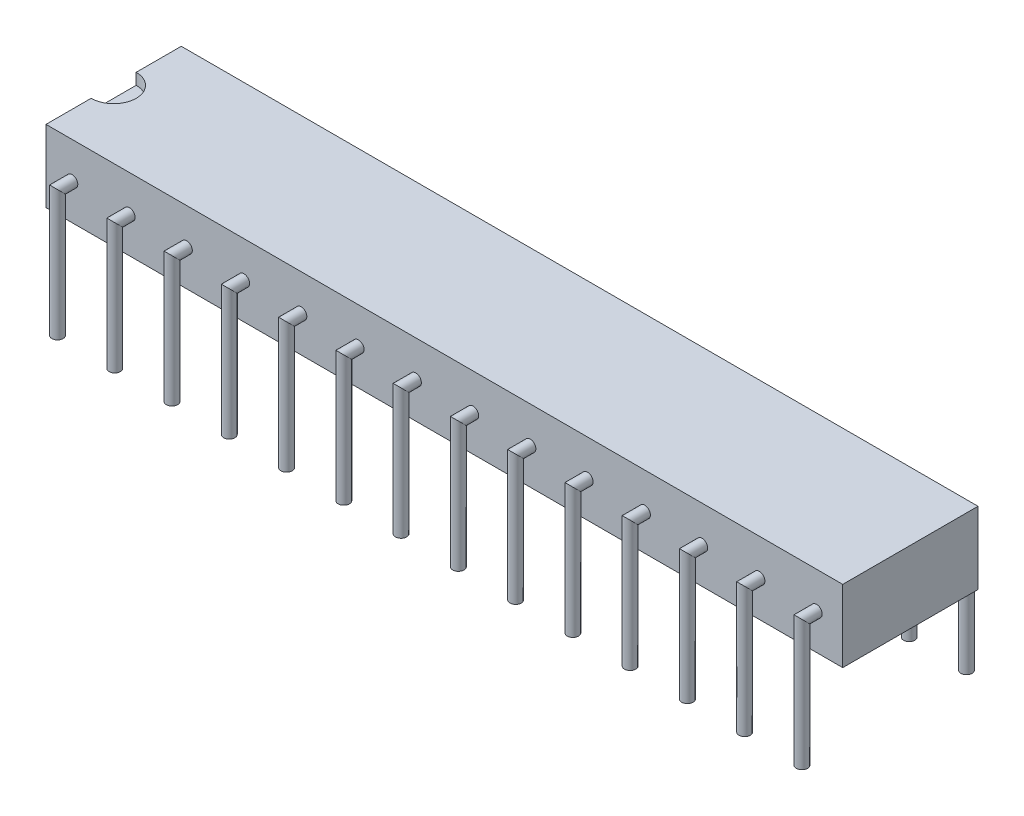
ISO-10303-21;
HEADER;
FILE_DESCRIPTION(('STEP AP214'),'2;1');
FILE_NAME('part.step','',(''),(''),'','','');
FILE_SCHEMA(('AUTOMOTIVE_DESIGN { 1 0 10303 214 1 1 1 1 }'));
ENDSEC;
DATA;
#1=APPLICATION_CONTEXT('core data for automotive mechanical design processes');
#2=APPLICATION_PROTOCOL_DEFINITION('international standard','automotive_design',2000,#1);
#3=PRODUCT_CONTEXT('',#1,'mechanical');
#4=PRODUCT('Part','Part','',(#3));
#5=PRODUCT_RELATED_PRODUCT_CATEGORY('part','',(#4));
#6=PRODUCT_DEFINITION_FORMATION('','',#4);
#7=PRODUCT_DEFINITION_CONTEXT('part definition',#1,'design');
#8=PRODUCT_DEFINITION('design','',#6,#7);
#9=PRODUCT_DEFINITION_SHAPE('','',#8);
#10=(LENGTH_UNIT() NAMED_UNIT(*) SI_UNIT(.MILLI.,.METRE.));
#11=(NAMED_UNIT(*) PLANE_ANGLE_UNIT() SI_UNIT($,.RADIAN.));
#12=(NAMED_UNIT(*) SI_UNIT($,.STERADIAN.) SOLID_ANGLE_UNIT());
#13=UNCERTAINTY_MEASURE_WITH_UNIT(LENGTH_MEASURE(1.E-05),#10,'distance_accuracy_value','');
#14=(GEOMETRIC_REPRESENTATION_CONTEXT(3) GLOBAL_UNCERTAINTY_ASSIGNED_CONTEXT((#13)) GLOBAL_UNIT_ASSIGNED_CONTEXT((#10,
#11,#12)) REPRESENTATION_CONTEXT('',''));
#15=CARTESIAN_POINT('',(0.,0.,0.));
#16=DIRECTION('',(0.,0.,1.));
#17=DIRECTION('',(1.,0.,0.));
#18=AXIS2_PLACEMENT_3D('',#15,#16,#17);
#19=CARTESIAN_POINT('',(35.34,3.2,3.));
#20=DIRECTION('',(0.,0.,-1.));
#21=DIRECTION('',(-1.,0.,0.));
#22=AXIS2_PLACEMENT_3D('',#19,#20,#21);
#23=PLANE('',#22);
#24=CARTESIAN_POINT('',(31.64,1.6,3.));
#25=DIRECTION('',(0.,0.,-1.));
#26=DIRECTION('',(-1.,0.,0.));
#27=AXIS2_PLACEMENT_3D('',#24,#25,#26);
#28=CIRCLE('',#27,0.25);
#29=CARTESIAN_POINT('',(31.39,1.6,3.));
#30=VERTEX_POINT('',#29);
#31=EDGE_CURVE('E65',#30,#30,#28,.F.);
#32=ORIENTED_EDGE('',*,*,#31,.F.);
#33=EDGE_LOOP('',(#32));
#34=FACE_BOUND('',#33,.T.);
#35=CARTESIAN_POINT('',(26.56,1.6,3.));
#36=DIRECTION('',(0.,0.,-1.));
#37=DIRECTION('',(-1.,0.,0.));
#38=AXIS2_PLACEMENT_3D('',#35,#36,#37);
#39=CIRCLE('',#38,0.25);
#40=CARTESIAN_POINT('',(26.31,1.6,3.));
#41=VERTEX_POINT('',#40);
#42=EDGE_CURVE('E186',#41,#41,#39,.F.);
#43=ORIENTED_EDGE('',*,*,#42,.F.);
#44=EDGE_LOOP('',(#43));
#45=FACE_BOUND('',#44,.T.);
#46=CARTESIAN_POINT('',(21.48,1.6,3.));
#47=DIRECTION('',(0.,0.,-1.));
#48=DIRECTION('',(-1.,0.,0.));
#49=AXIS2_PLACEMENT_3D('',#46,#47,#48);
#50=CIRCLE('',#49,0.25);
#51=CARTESIAN_POINT('',(21.23,1.6,3.));
#52=VERTEX_POINT('',#51);
#53=EDGE_CURVE('E180',#52,#52,#50,.F.);
#54=ORIENTED_EDGE('',*,*,#53,.F.);
#55=EDGE_LOOP('',(#54));
#56=FACE_BOUND('',#55,.T.);
#57=CARTESIAN_POINT('',(16.4,1.6,3.));
#58=DIRECTION('',(0.,0.,-1.));
#59=DIRECTION('',(-1.,0.,0.));
#60=AXIS2_PLACEMENT_3D('',#57,#58,#59);
#61=CIRCLE('',#60,0.25);
#62=CARTESIAN_POINT('',(16.15,1.6,3.));
#63=VERTEX_POINT('',#62);
#64=EDGE_CURVE('E174',#63,#63,#61,.F.);
#65=ORIENTED_EDGE('',*,*,#64,.F.);
#66=EDGE_LOOP('',(#65));
#67=FACE_BOUND('',#66,.T.);
#68=CARTESIAN_POINT('',(11.32,1.6,3.));
#69=DIRECTION('',(0.,0.,-1.));
#70=DIRECTION('',(-1.,0.,0.));
#71=AXIS2_PLACEMENT_3D('',#68,#69,#70);
#72=CIRCLE('',#71,0.25);
#73=CARTESIAN_POINT('',(11.07,1.6,3.));
#74=VERTEX_POINT('',#73);
#75=EDGE_CURVE('E168',#74,#74,#72,.F.);
#76=ORIENTED_EDGE('',*,*,#75,.F.);
#77=EDGE_LOOP('',(#76));
#78=FACE_BOUND('',#77,.T.);
#79=CARTESIAN_POINT('',(6.24,1.6,3.));
#80=DIRECTION('',(0.,0.,-1.));
#81=DIRECTION('',(-1.,0.,0.));
#82=AXIS2_PLACEMENT_3D('',#79,#80,#81);
#83=CIRCLE('',#82,0.25);
#84=CARTESIAN_POINT('',(5.99,1.6,3.));
#85=VERTEX_POINT('',#84);
#86=EDGE_CURVE('E162',#85,#85,#83,.F.);
#87=ORIENTED_EDGE('',*,*,#86,.F.);
#88=EDGE_LOOP('',(#87));
#89=FACE_BOUND('',#88,.T.);
#90=CARTESIAN_POINT('',(1.16,1.6,3.));
#91=DIRECTION('',(0.,0.,-1.));
#92=DIRECTION('',(-1.,0.,0.));
#93=AXIS2_PLACEMENT_3D('',#90,#91,#92);
#94=CIRCLE('',#93,0.25);
#95=CARTESIAN_POINT('',(0.91,1.6,3.));
#96=VERTEX_POINT('',#95);
#97=EDGE_CURVE('E156',#96,#96,#94,.F.);
#98=ORIENTED_EDGE('',*,*,#97,.F.);
#99=EDGE_LOOP('',(#98));
#100=FACE_BOUND('',#99,.T.);
#101=DIRECTION('',(0.,-1.,0.));
#102=VECTOR('',#101,1.);
#103=CARTESIAN_POINT('',(0.,3.2,3.));
#104=LINE('',#103,#102);
#105=CARTESIAN_POINT('',(0.,3.2,3.));
#106=VERTEX_POINT('',#105);
#107=CARTESIAN_POINT('',(0.,0.,3.));
#108=VERTEX_POINT('',#107);
#109=EDGE_CURVE('E216',#106,#108,#104,.T.);
#110=ORIENTED_EDGE('',*,*,#109,.T.);
#111=DIRECTION('',(-1.,0.,0.));
#112=VECTOR('',#111,1.);
#113=CARTESIAN_POINT('',(35.34,0.,3.));
#114=LINE('',#113,#112);
#115=CARTESIAN_POINT('',(35.34,0.,3.));
#116=VERTEX_POINT('',#115);
#117=EDGE_CURVE('E153',#116,#108,#114,.T.);
#118=ORIENTED_EDGE('',*,*,#117,.F.);
#119=DIRECTION('',(0.,-1.,0.));
#120=VECTOR('',#119,1.);
#121=CARTESIAN_POINT('',(35.34,3.2,3.));
#122=LINE('',#121,#120);
#123=CARTESIAN_POINT('',(35.34,3.2,3.));
#124=VERTEX_POINT('',#123);
#125=EDGE_CURVE('E133',#124,#116,#122,.T.);
#126=ORIENTED_EDGE('',*,*,#125,.F.);
#127=DIRECTION('',(-1.,0.,0.));
#128=VECTOR('',#127,1.);
#129=CARTESIAN_POINT('',(35.34,3.2,3.));
#130=LINE('',#129,#128);
#131=EDGE_CURVE('E146',#124,#106,#130,.T.);
#132=ORIENTED_EDGE('',*,*,#131,.T.);
#133=EDGE_LOOP('',(#110,#118,#126,#132));
#134=FACE_BOUND('',#133,.T.);
#135=CARTESIAN_POINT('',(3.7,1.6,3.));
#136=DIRECTION('',(0.,0.,-1.));
#137=DIRECTION('',(-1.,0.,0.));
#138=AXIS2_PLACEMENT_3D('',#135,#136,#137);
#139=CIRCLE('',#138,0.25);
#140=CARTESIAN_POINT('',(3.45,1.6,3.));
#141=VERTEX_POINT('',#140);
#142=EDGE_CURVE('E159',#141,#141,#139,.F.);
#143=ORIENTED_EDGE('',*,*,#142,.F.);
#144=EDGE_LOOP('',(#143));
#145=FACE_BOUND('',#144,.T.);
#146=CARTESIAN_POINT('',(8.78,1.6,3.));
#147=DIRECTION('',(0.,0.,-1.));
#148=DIRECTION('',(-1.,0.,0.));
#149=AXIS2_PLACEMENT_3D('',#146,#147,#148);
#150=CIRCLE('',#149,0.25);
#151=CARTESIAN_POINT('',(8.53,1.6,3.));
#152=VERTEX_POINT('',#151);
#153=EDGE_CURVE('E165',#152,#152,#150,.F.);
#154=ORIENTED_EDGE('',*,*,#153,.F.);
#155=EDGE_LOOP('',(#154));
#156=FACE_BOUND('',#155,.T.);
#157=CARTESIAN_POINT('',(13.86,1.6,3.));
#158=DIRECTION('',(0.,0.,-1.));
#159=DIRECTION('',(-1.,0.,0.));
#160=AXIS2_PLACEMENT_3D('',#157,#158,#159);
#161=CIRCLE('',#160,0.25);
#162=CARTESIAN_POINT('',(13.61,1.6,3.));
#163=VERTEX_POINT('',#162);
#164=EDGE_CURVE('E171',#163,#163,#161,.F.);
#165=ORIENTED_EDGE('',*,*,#164,.F.);
#166=EDGE_LOOP('',(#165));
#167=FACE_BOUND('',#166,.T.);
#168=CARTESIAN_POINT('',(18.94,1.6,3.));
#169=DIRECTION('',(0.,0.,-1.));
#170=DIRECTION('',(-1.,0.,0.));
#171=AXIS2_PLACEMENT_3D('',#168,#169,#170);
#172=CIRCLE('',#171,0.25);
#173=CARTESIAN_POINT('',(18.69,1.6,3.));
#174=VERTEX_POINT('',#173);
#175=EDGE_CURVE('E177',#174,#174,#172,.F.);
#176=ORIENTED_EDGE('',*,*,#175,.F.);
#177=EDGE_LOOP('',(#176));
#178=FACE_BOUND('',#177,.T.);
#179=CARTESIAN_POINT('',(24.02,1.6,3.));
#180=DIRECTION('',(0.,0.,-1.));
#181=DIRECTION('',(-1.,0.,0.));
#182=AXIS2_PLACEMENT_3D('',#179,#180,#181);
#183=CIRCLE('',#182,0.25);
#184=CARTESIAN_POINT('',(23.77,1.6,3.));
#185=VERTEX_POINT('',#184);
#186=EDGE_CURVE('E183',#185,#185,#183,.F.);
#187=ORIENTED_EDGE('',*,*,#186,.F.);
#188=EDGE_LOOP('',(#187));
#189=FACE_BOUND('',#188,.T.);
#190=CARTESIAN_POINT('',(29.1,1.6,3.));
#191=DIRECTION('',(0.,0.,-1.));
#192=DIRECTION('',(-1.,0.,0.));
#193=AXIS2_PLACEMENT_3D('',#190,#191,#192);
#194=CIRCLE('',#193,0.25);
#195=CARTESIAN_POINT('',(28.85,1.6,3.));
#196=VERTEX_POINT('',#195);
#197=EDGE_CURVE('E189',#196,#196,#194,.F.);
#198=ORIENTED_EDGE('',*,*,#197,.F.);
#199=EDGE_LOOP('',(#198));
#200=FACE_BOUND('',#199,.T.);
#201=CARTESIAN_POINT('',(34.18,1.6,3.));
#202=DIRECTION('',(0.,0.,-1.));
#203=DIRECTION('',(-1.,0.,0.));
#204=AXIS2_PLACEMENT_3D('',#201,#202,#203);
#205=CIRCLE('',#204,0.25);
#206=CARTESIAN_POINT('',(33.93,1.6,3.));
#207=VERTEX_POINT('',#206);
#208=EDGE_CURVE('E12',#207,#207,#205,.F.);
#209=ORIENTED_EDGE('',*,*,#208,.F.);
#210=EDGE_LOOP('',(#209));
#211=FACE_BOUND('',#210,.T.);
#212=ADVANCED_FACE('F58',(#34,#45,#56,#67,#78,#89,#100,#134,#145,#156,#167,#178,#189,#200,#211),
#23,.F.);
#213=CARTESIAN_POINT('',(35.34,0.,3.));
#214=DIRECTION('',(0.,1.,0.));
#215=DIRECTION('',(0.,0.,1.));
#216=AXIS2_PLACEMENT_3D('',#213,#214,#215);
#217=PLANE('',#216);
#218=DIRECTION('',(0.,0.,-1.));
#219=VECTOR('',#218,1.);
#220=CARTESIAN_POINT('',(0.,0.,3.));
#221=LINE('',#220,#219);
#222=CARTESIAN_POINT('',(0.,0.,-3.));
#223=VERTEX_POINT('',#222);
#224=EDGE_CURVE('E340',#108,#223,#221,.T.);
#225=ORIENTED_EDGE('',*,*,#224,.T.);
#226=DIRECTION('',(-1.,0.,0.));
#227=VECTOR('',#226,1.);
#228=CARTESIAN_POINT('',(35.34,0.,-3.));
#229=LINE('',#228,#227);
#230=CARTESIAN_POINT('',(35.34,0.,-3.));
#231=VERTEX_POINT('',#230);
#232=EDGE_CURVE('E150',#231,#223,#229,.T.);
#233=ORIENTED_EDGE('',*,*,#232,.F.);
#234=DIRECTION('',(0.,0.,-1.));
#235=VECTOR('',#234,1.);
#236=CARTESIAN_POINT('',(35.34,0.,3.));
#237=LINE('',#236,#235);
#238=EDGE_CURVE('E136',#116,#231,#237,.T.);
#239=ORIENTED_EDGE('',*,*,#238,.F.);
#240=ORIENTED_EDGE('',*,*,#117,.T.);
#241=EDGE_LOOP('',(#225,#233,#239,#240));
#242=FACE_BOUND('',#241,.T.);
#243=ADVANCED_FACE('F199',(#242),#217,.F.);
#244=CARTESIAN_POINT('',(35.34,3.2,-3.));
#245=DIRECTION('',(0.,0.,1.));
#246=DIRECTION('',(1.,0.,0.));
#247=AXIS2_PLACEMENT_3D('',#244,#245,#246);
#248=PLANE('',#247);
#249=CARTESIAN_POINT('',(34.18,1.6,-3.));
#250=DIRECTION('',(0.,0.,1.));
#251=DIRECTION('',(1.,0.,0.));
#252=AXIS2_PLACEMENT_3D('',#249,#250,#251);
#253=CIRCLE('',#252,0.25);
#254=CARTESIAN_POINT('',(34.43,1.6,-3.));
#255=VERTEX_POINT('',#254);
#256=EDGE_CURVE('E1247',#255,#255,#253,.T.);
#257=ORIENTED_EDGE('',*,*,#256,.T.);
#258=EDGE_LOOP('',(#257));
#259=FACE_BOUND('',#258,.T.);
#260=CARTESIAN_POINT('',(31.64,1.6,-3.));
#261=DIRECTION('',(0.,0.,1.));
#262=DIRECTION('',(1.,0.,0.));
#263=AXIS2_PLACEMENT_3D('',#260,#261,#262);
#264=CIRCLE('',#263,0.25);
#265=CARTESIAN_POINT('',(31.89,1.6,-3.));
#266=VERTEX_POINT('',#265);
#267=EDGE_CURVE('E1240',#266,#266,#264,.T.);
#268=ORIENTED_EDGE('',*,*,#267,.T.);
#269=EDGE_LOOP('',(#268));
#270=FACE_BOUND('',#269,.T.);
#271=CARTESIAN_POINT('',(29.1,1.6,-3.));
#272=DIRECTION('',(0.,0.,1.));
#273=DIRECTION('',(1.,0.,0.));
#274=AXIS2_PLACEMENT_3D('',#271,#272,#273);
#275=CIRCLE('',#274,0.25);
#276=CARTESIAN_POINT('',(29.35,1.6,-3.));
#277=VERTEX_POINT('',#276);
#278=EDGE_CURVE('E1256',#277,#277,#275,.T.);
#279=ORIENTED_EDGE('',*,*,#278,.T.);
#280=EDGE_LOOP('',(#279));
#281=FACE_BOUND('',#280,.T.);
#282=CARTESIAN_POINT('',(26.56,1.6,-3.));
#283=DIRECTION('',(0.,0.,1.));
#284=DIRECTION('',(1.,0.,0.));
#285=AXIS2_PLACEMENT_3D('',#282,#283,#284);
#286=CIRCLE('',#285,0.25);
#287=CARTESIAN_POINT('',(26.81,1.6,-3.));
#288=VERTEX_POINT('',#287);
#289=EDGE_CURVE('E1265',#288,#288,#286,.T.);
#290=ORIENTED_EDGE('',*,*,#289,.T.);
#291=EDGE_LOOP('',(#290));
#292=FACE_BOUND('',#291,.T.);
#293=CARTESIAN_POINT('',(24.02,1.6,-3.));
#294=DIRECTION('',(0.,0.,1.));
#295=DIRECTION('',(1.,0.,0.));
#296=AXIS2_PLACEMENT_3D('',#293,#294,#295);
#297=CIRCLE('',#296,0.25);
#298=CARTESIAN_POINT('',(24.27,1.6,-3.));
#299=VERTEX_POINT('',#298);
#300=EDGE_CURVE('E1274',#299,#299,#297,.T.);
#301=ORIENTED_EDGE('',*,*,#300,.T.);
#302=EDGE_LOOP('',(#301));
#303=FACE_BOUND('',#302,.T.);
#304=CARTESIAN_POINT('',(21.48,1.6,-3.));
#305=DIRECTION('',(0.,0.,1.));
#306=DIRECTION('',(1.,0.,0.));
#307=AXIS2_PLACEMENT_3D('',#304,#305,#306);
#308=CIRCLE('',#307,0.25);
#309=CARTESIAN_POINT('',(21.73,1.6,-3.));
#310=VERTEX_POINT('',#309);
#311=EDGE_CURVE('E1283',#310,#310,#308,.T.);
#312=ORIENTED_EDGE('',*,*,#311,.T.);
#313=EDGE_LOOP('',(#312));
#314=FACE_BOUND('',#313,.T.);
#315=CARTESIAN_POINT('',(18.94,1.6,-3.));
#316=DIRECTION('',(0.,0.,1.));
#317=DIRECTION('',(1.,0.,0.));
#318=AXIS2_PLACEMENT_3D('',#315,#316,#317);
#319=CIRCLE('',#318,0.25);
#320=CARTESIAN_POINT('',(19.19,1.6,-3.));
#321=VERTEX_POINT('',#320);
#322=EDGE_CURVE('E1292',#321,#321,#319,.T.);
#323=ORIENTED_EDGE('',*,*,#322,.T.);
#324=EDGE_LOOP('',(#323));
#325=FACE_BOUND('',#324,.T.);
#326=CARTESIAN_POINT('',(16.4,1.6,-3.));
#327=DIRECTION('',(0.,0.,1.));
#328=DIRECTION('',(1.,0.,0.));
#329=AXIS2_PLACEMENT_3D('',#326,#327,#328);
#330=CIRCLE('',#329,0.25);
#331=CARTESIAN_POINT('',(16.65,1.6,-3.));
#332=VERTEX_POINT('',#331);
#333=EDGE_CURVE('E1301',#332,#332,#330,.T.);
#334=ORIENTED_EDGE('',*,*,#333,.T.);
#335=EDGE_LOOP('',(#334));
#336=FACE_BOUND('',#335,.T.);
#337=CARTESIAN_POINT('',(13.86,1.6,-3.));
#338=DIRECTION('',(0.,0.,1.));
#339=DIRECTION('',(1.,0.,0.));
#340=AXIS2_PLACEMENT_3D('',#337,#338,#339);
#341=CIRCLE('',#340,0.25);
#342=CARTESIAN_POINT('',(14.11,1.6,-3.));
#343=VERTEX_POINT('',#342);
#344=EDGE_CURVE('E1310',#343,#343,#341,.T.);
#345=ORIENTED_EDGE('',*,*,#344,.T.);
#346=EDGE_LOOP('',(#345));
#347=FACE_BOUND('',#346,.T.);
#348=CARTESIAN_POINT('',(11.32,1.6,-3.));
#349=DIRECTION('',(0.,0.,1.));
#350=DIRECTION('',(1.,0.,0.));
#351=AXIS2_PLACEMENT_3D('',#348,#349,#350);
#352=CIRCLE('',#351,0.25);
#353=CARTESIAN_POINT('',(11.57,1.6,-3.));
#354=VERTEX_POINT('',#353);
#355=EDGE_CURVE('E1319',#354,#354,#352,.T.);
#356=ORIENTED_EDGE('',*,*,#355,.T.);
#357=EDGE_LOOP('',(#356));
#358=FACE_BOUND('',#357,.T.);
#359=CARTESIAN_POINT('',(8.78,1.6,-3.));
#360=DIRECTION('',(0.,0.,1.));
#361=DIRECTION('',(1.,0.,0.));
#362=AXIS2_PLACEMENT_3D('',#359,#360,#361);
#363=CIRCLE('',#362,0.25);
#364=CARTESIAN_POINT('',(9.03,1.6,-3.));
#365=VERTEX_POINT('',#364);
#366=EDGE_CURVE('E1328',#365,#365,#363,.T.);
#367=ORIENTED_EDGE('',*,*,#366,.T.);
#368=EDGE_LOOP('',(#367));
#369=FACE_BOUND('',#368,.T.);
#370=CARTESIAN_POINT('',(6.24,1.6,-3.));
#371=DIRECTION('',(0.,0.,1.));
#372=DIRECTION('',(1.,0.,0.));
#373=AXIS2_PLACEMENT_3D('',#370,#371,#372);
#374=CIRCLE('',#373,0.25);
#375=CARTESIAN_POINT('',(6.49,1.6,-3.));
#376=VERTEX_POINT('',#375);
#377=EDGE_CURVE('E1337',#376,#376,#374,.T.);
#378=ORIENTED_EDGE('',*,*,#377,.T.);
#379=EDGE_LOOP('',(#378));
#380=FACE_BOUND('',#379,.T.);
#381=CARTESIAN_POINT('',(3.7,1.6,-3.));
#382=DIRECTION('',(0.,0.,1.));
#383=DIRECTION('',(1.,0.,0.));
#384=AXIS2_PLACEMENT_3D('',#381,#382,#383);
#385=CIRCLE('',#384,0.25);
#386=CARTESIAN_POINT('',(3.95,1.6,-3.));
#387=VERTEX_POINT('',#386);
#388=EDGE_CURVE('E1346',#387,#387,#385,.T.);
#389=ORIENTED_EDGE('',*,*,#388,.T.);
#390=EDGE_LOOP('',(#389));
#391=FACE_BOUND('',#390,.T.);
#392=CARTESIAN_POINT('',(1.16,1.6,-3.));
#393=DIRECTION('',(0.,0.,1.));
#394=DIRECTION('',(1.,0.,0.));
#395=AXIS2_PLACEMENT_3D('',#392,#393,#394);
#396=CIRCLE('',#395,0.25);
#397=CARTESIAN_POINT('',(1.41,1.6,-3.));
#398=VERTEX_POINT('',#397);
#399=EDGE_CURVE('E323',#398,#398,#396,.T.);
#400=ORIENTED_EDGE('',*,*,#399,.T.);
#401=EDGE_LOOP('',(#400));
#402=FACE_BOUND('',#401,.T.);
#403=DIRECTION('',(0.,1.,0.));
#404=VECTOR('',#403,1.);
#405=CARTESIAN_POINT('',(0.,3.2,-3.));
#406=LINE('',#405,#404);
#407=CARTESIAN_POINT('',(0.,3.2,-3.));
#408=VERTEX_POINT('',#407);
#409=EDGE_CURVE('E138',#223,#408,#406,.T.);
#410=ORIENTED_EDGE('',*,*,#409,.T.);
#411=DIRECTION('',(-1.,0.,0.));
#412=VECTOR('',#411,1.);
#413=CARTESIAN_POINT('',(35.34,3.2,-3.));
#414=LINE('',#413,#412);
#415=CARTESIAN_POINT('',(35.34,3.2,-3.));
#416=VERTEX_POINT('',#415);
#417=EDGE_CURVE('E132',#416,#408,#414,.T.);
#418=ORIENTED_EDGE('',*,*,#417,.F.);
#419=DIRECTION('',(0.,1.,0.));
#420=VECTOR('',#419,1.);
#421=CARTESIAN_POINT('',(35.34,3.2,-3.));
#422=LINE('',#421,#420);
#423=EDGE_CURVE('E143',#231,#416,#422,.T.);
#424=ORIENTED_EDGE('',*,*,#423,.F.);
#425=ORIENTED_EDGE('',*,*,#232,.T.);
#426=EDGE_LOOP('',(#410,#418,#424,#425));
#427=FACE_BOUND('',#426,.T.);
#428=ADVANCED_FACE('F344',(#259,#270,#281,#292,#303,#314,#325,#336,#347,#358,#369,#380,#391,
#402,#427),#248,.F.);
#429=CARTESIAN_POINT('',(35.34,3.2,3.));
#430=DIRECTION('',(0.,-1.,0.));
#431=DIRECTION('',(0.,0.,-1.));
#432=AXIS2_PLACEMENT_3D('',#429,#430,#431);
#433=PLANE('',#432);
#434=DIRECTION('',(0.,0.,1.));
#435=VECTOR('',#434,1.);
#436=CARTESIAN_POINT('',(0.,3.2,3.));
#437=LINE('',#436,#435);
#438=CARTESIAN_POINT('',(0.,3.2,-1.));
#439=VERTEX_POINT('',#438);
#440=EDGE_CURVE('E126',#408,#439,#437,.T.);
#441=ORIENTED_EDGE('',*,*,#440,.T.);
#442=CARTESIAN_POINT('',(0.,3.2,0.));
#443=DIRECTION('',(0.,1.,0.));
#444=DIRECTION('',(0.,0.,1.));
#445=AXIS2_PLACEMENT_3D('',#442,#443,#444);
#446=CIRCLE('',#445,1.);
#447=CARTESIAN_POINT('',(0.,3.2,1.));
#448=VERTEX_POINT('',#447);
#449=EDGE_CURVE('E110',#448,#439,#446,.T.);
#450=ORIENTED_EDGE('',*,*,#449,.F.);
#451=EDGE_CURVE('E134',#448,#106,#437,.T.);
#452=ORIENTED_EDGE('',*,*,#451,.T.);
#453=ORIENTED_EDGE('',*,*,#131,.F.);
#454=DIRECTION('',(0.,0.,1.));
#455=VECTOR('',#454,1.);
#456=CARTESIAN_POINT('',(35.34,3.2,3.));
#457=LINE('',#456,#455);
#458=EDGE_CURVE('E79',#416,#124,#457,.T.);
#459=ORIENTED_EDGE('',*,*,#458,.F.);
#460=ORIENTED_EDGE('',*,*,#417,.T.);
#461=EDGE_LOOP('',(#441,#450,#452,#453,#459,#460));
#462=FACE_BOUND('',#461,.T.);
#463=ADVANCED_FACE('F130',(#462),#433,.F.);
#464=CARTESIAN_POINT('',(35.34,0.,3.));
#465=DIRECTION('',(1.,0.,0.));
#466=DIRECTION('',(0.,0.,-1.));
#467=AXIS2_PLACEMENT_3D('',#464,#465,#466);
#468=PLANE('',#467);
#469=ORIENTED_EDGE('',*,*,#125,.T.);
#470=ORIENTED_EDGE('',*,*,#238,.T.);
#471=ORIENTED_EDGE('',*,*,#423,.T.);
#472=ORIENTED_EDGE('',*,*,#458,.T.);
#473=EDGE_LOOP('',(#469,#470,#471,#472));
#474=FACE_BOUND('',#473,.T.);
#475=ADVANCED_FACE('F347',(#474),#468,.T.);
#476=CARTESIAN_POINT('',(0.,0.,3.));
#477=DIRECTION('',(1.,0.,0.));
#478=DIRECTION('',(0.,0.,-1.));
#479=AXIS2_PLACEMENT_3D('',#476,#477,#478);
#480=PLANE('',#479);
#481=DIRECTION('',(0.,0.,1.));
#482=VECTOR('',#481,1.);
#483=CARTESIAN_POINT('',(0.,2.7,-1.));
#484=LINE('',#483,#482);
#485=CARTESIAN_POINT('',(0.,2.7,-1.));
#486=VERTEX_POINT('',#485);
#487=CARTESIAN_POINT('',(0.,2.7,1.));
#488=VERTEX_POINT('',#487);
#489=EDGE_CURVE('E127',#486,#488,#484,.T.);
#490=ORIENTED_EDGE('',*,*,#489,.F.);
#491=DIRECTION('',(0.,1.,0.));
#492=VECTOR('',#491,1.);
#493=CARTESIAN_POINT('',(0.,2.7,-1.));
#494=LINE('',#493,#492);
#495=EDGE_CURVE('E113',#486,#439,#494,.T.);
#496=ORIENTED_EDGE('',*,*,#495,.T.);
#497=ORIENTED_EDGE('',*,*,#440,.F.);
#498=ORIENTED_EDGE('',*,*,#409,.F.);
#499=ORIENTED_EDGE('',*,*,#224,.F.);
#500=ORIENTED_EDGE('',*,*,#109,.F.);
#501=ORIENTED_EDGE('',*,*,#451,.F.);
#502=DIRECTION('',(0.,1.,0.));
#503=VECTOR('',#502,1.);
#504=CARTESIAN_POINT('',(0.,2.7,1.));
#505=LINE('',#504,#503);
#506=EDGE_CURVE('E116',#488,#448,#505,.T.);
#507=ORIENTED_EDGE('',*,*,#506,.F.);
#508=EDGE_LOOP('',(#490,#496,#497,#498,#499,#500,#501,#507));
#509=FACE_BOUND('',#508,.T.);
#510=ADVANCED_FACE('F124',(#509),#480,.F.);
#511=CARTESIAN_POINT('',(0.,2.7,0.));
#512=DIRECTION('',(0.,1.,0.));
#513=DIRECTION('',(0.,0.,1.));
#514=AXIS2_PLACEMENT_3D('',#511,#512,#513);
#515=CYLINDRICAL_SURFACE('',#514,1.);
#516=ORIENTED_EDGE('',*,*,#449,.T.);
#517=ORIENTED_EDGE('',*,*,#495,.F.);
#518=CARTESIAN_POINT('',(0.,2.7,0.));
#519=DIRECTION('',(0.,1.,0.));
#520=DIRECTION('',(0.,0.,1.));
#521=AXIS2_PLACEMENT_3D('',#518,#519,#520);
#522=CIRCLE('',#521,1.);
#523=EDGE_CURVE('E71',#488,#486,#522,.T.);
#524=ORIENTED_EDGE('',*,*,#523,.F.);
#525=ORIENTED_EDGE('',*,*,#506,.T.);
#526=EDGE_LOOP('',(#516,#517,#524,#525));
#527=FACE_BOUND('',#526,.T.);
#528=ADVANCED_FACE('F112',(#527),#515,.F.);
#529=CARTESIAN_POINT('',(0.,2.7,0.));
#530=DIRECTION('',(0.,1.,0.));
#531=DIRECTION('',(0.,0.,1.));
#532=AXIS2_PLACEMENT_3D('',#529,#530,#531);
#533=PLANE('',#532);
#534=ORIENTED_EDGE('',*,*,#523,.T.);
#535=ORIENTED_EDGE('',*,*,#489,.T.);
#536=EDGE_LOOP('',(#534,#535));
#537=FACE_BOUND('',#536,.T.);
#538=ADVANCED_FACE('F391',(#537),#533,.T.);
#539=CARTESIAN_POINT('',(1.16,1.6,3.65));
#540=DIRECTION('',(0.,-1.,0.));
#541=DIRECTION('',(0.,0.,-1.));
#542=AXIS2_PLACEMENT_3D('',#539,#540,#541);
#543=CYLINDRICAL_SURFACE('',#542,0.25);
#544=CARTESIAN_POINT('',(1.16,1.6,3.65));
#545=DIRECTION('',(0.,-0.707106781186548,0.707106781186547));
#546=DIRECTION('',(0.,-0.707106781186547,-0.707106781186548));
#547=AXIS2_PLACEMENT_3D('',#544,#545,#546);
#548=ELLIPSE('',#547,0.353553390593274,0.25);
#549=CARTESIAN_POINT('',(1.16,1.35,3.4));
#550=VERTEX_POINT('',#549);
#551=EDGE_CURVE('E332',#550,#550,#548,.T.);
#552=ORIENTED_EDGE('',*,*,#551,.T.);
#553=EDGE_LOOP('',(#552));
#554=FACE_BOUND('',#553,.T.);
#555=CARTESIAN_POINT('',(1.16,-4.,3.65));
#556=DIRECTION('',(0.,-1.,0.));
#557=DIRECTION('',(0.,0.,-1.));
#558=AXIS2_PLACEMENT_3D('',#555,#556,#557);
#559=CIRCLE('',#558,0.25);
#560=CARTESIAN_POINT('',(1.16,-4.,3.4));
#561=VERTEX_POINT('',#560);
#562=EDGE_CURVE('E120',#561,#561,#559,.F.);
#563=ORIENTED_EDGE('',*,*,#562,.T.);
#564=EDGE_LOOP('',(#563));
#565=FACE_BOUND('',#564,.T.);
#566=ADVANCED_FACE('F399',(#554,#565),#543,.T.);
#567=CARTESIAN_POINT('',(1.16,1.6,4.35710678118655));
#568=DIRECTION('',(0.,0.,-1.));
#569=DIRECTION('',(0.,1.,0.));
#570=AXIS2_PLACEMENT_3D('',#567,#568,#569);
#571=CYLINDRICAL_SURFACE('',#570,0.25);
#572=ORIENTED_EDGE('',*,*,#97,.T.);
#573=EDGE_LOOP('',(#572));
#574=FACE_BOUND('',#573,.T.);
#575=ORIENTED_EDGE('',*,*,#551,.F.);
#576=EDGE_LOOP('',(#575));
#577=FACE_BOUND('',#576,.T.);
#578=ADVANCED_FACE('F408',(#574,#577),#571,.T.);
#579=CARTESIAN_POINT('',(1.16,-4.,3.65));
#580=DIRECTION('',(0.,-1.,0.));
#581=DIRECTION('',(0.,0.,-1.));
#582=AXIS2_PLACEMENT_3D('',#579,#580,#581);
#583=PLANE('',#582);
#584=ORIENTED_EDGE('',*,*,#562,.F.);
#585=EDGE_LOOP('',(#584));
#586=FACE_BOUND('',#585,.T.);
#587=ADVANCED_FACE('F418',(#586),#583,.T.);
#588=CARTESIAN_POINT('',(1.16,1.6,-3.65));
#589=DIRECTION('',(0.,-1.,0.));
#590=DIRECTION('',(0.,0.,-1.));
#591=AXIS2_PLACEMENT_3D('',#588,#589,#590);
#592=CYLINDRICAL_SURFACE('',#591,0.25);
#593=CARTESIAN_POINT('',(1.16,1.6,-3.65));
#594=DIRECTION('',(0.,-0.707106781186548,-0.707106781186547));
#595=DIRECTION('',(0.,-0.707106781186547,0.707106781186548));
#596=AXIS2_PLACEMENT_3D('',#593,#594,#595);
#597=ELLIPSE('',#596,0.353553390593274,0.25);
#598=CARTESIAN_POINT('',(1.16,1.35,-3.4));
#599=VERTEX_POINT('',#598);
#600=EDGE_CURVE('E326',#599,#599,#597,.F.);
#601=ORIENTED_EDGE('',*,*,#600,.F.);
#602=EDGE_LOOP('',(#601));
#603=FACE_BOUND('',#602,.T.);
#604=CARTESIAN_POINT('',(1.16,-4.,-3.65));
#605=DIRECTION('',(0.,-1.,0.));
#606=DIRECTION('',(0.,0.,-1.));
#607=AXIS2_PLACEMENT_3D('',#604,#605,#606);
#608=CIRCLE('',#607,0.25);
#609=CARTESIAN_POINT('',(1.16,-4.,-3.9));
#610=VERTEX_POINT('',#609);
#611=EDGE_CURVE('E329',#610,#610,#608,.T.);
#612=ORIENTED_EDGE('',*,*,#611,.F.);
#613=EDGE_LOOP('',(#612));
#614=FACE_BOUND('',#613,.T.);
#615=ADVANCED_FACE('F428',(#603,#614),#592,.T.);
#616=CARTESIAN_POINT('',(1.16,1.6,-4.35710678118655));
#617=DIRECTION('',(0.,0.,1.));
#618=DIRECTION('',(0.,-1.,0.));
#619=AXIS2_PLACEMENT_3D('',#616,#617,#618);
#620=CYLINDRICAL_SURFACE('',#619,0.25);
#621=ORIENTED_EDGE('',*,*,#399,.F.);
#622=EDGE_LOOP('',(#621));
#623=FACE_BOUND('',#622,.T.);
#624=ORIENTED_EDGE('',*,*,#600,.T.);
#625=EDGE_LOOP('',(#624));
#626=FACE_BOUND('',#625,.T.);
#627=ADVANCED_FACE('F438',(#623,#626),#620,.T.);
#628=CARTESIAN_POINT('',(1.16,-4.,-3.65));
#629=DIRECTION('',(0.,-1.,0.));
#630=DIRECTION('',(0.,0.,-1.));
#631=AXIS2_PLACEMENT_3D('',#628,#629,#630);
#632=PLANE('',#631);
#633=ORIENTED_EDGE('',*,*,#611,.T.);
#634=EDGE_LOOP('',(#633));
#635=FACE_BOUND('',#634,.T.);
#636=ADVANCED_FACE('F448',(#635),#632,.T.);
#637=CARTESIAN_POINT('',(3.7,1.6,3.65));
#638=DIRECTION('',(0.,-1.,0.));
#639=DIRECTION('',(0.,0.,-1.));
#640=AXIS2_PLACEMENT_3D('',#637,#638,#639);
#641=CYLINDRICAL_SURFACE('',#640,0.25);
#642=CARTESIAN_POINT('',(3.7,1.6,3.65));
#643=DIRECTION('',(0.,-0.707106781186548,0.707106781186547));
#644=DIRECTION('',(0.,-0.707106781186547,-0.707106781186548));
#645=AXIS2_PLACEMENT_3D('',#642,#643,#644);
#646=ELLIPSE('',#645,0.353553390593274,0.25);
#647=CARTESIAN_POINT('',(3.7,1.35,3.4));
#648=VERTEX_POINT('',#647);
#649=EDGE_CURVE('E317',#648,#648,#646,.T.);
#650=ORIENTED_EDGE('',*,*,#649,.T.);
#651=EDGE_LOOP('',(#650));
#652=FACE_BOUND('',#651,.T.);
#653=CARTESIAN_POINT('',(3.7,-4.,3.65));
#654=DIRECTION('',(0.,-1.,0.));
#655=DIRECTION('',(0.,0.,-1.));
#656=AXIS2_PLACEMENT_3D('',#653,#654,#655);
#657=CIRCLE('',#656,0.25);
#658=CARTESIAN_POINT('',(3.7,-4.,3.4));
#659=VERTEX_POINT('',#658);
#660=EDGE_CURVE('E320',#659,#659,#657,.F.);
#661=ORIENTED_EDGE('',*,*,#660,.T.);
#662=EDGE_LOOP('',(#661));
#663=FACE_BOUND('',#662,.T.);
#664=ADVANCED_FACE('F457',(#652,#663),#641,.T.);
#665=CARTESIAN_POINT('',(3.7,1.6,4.35710678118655));
#666=DIRECTION('',(0.,0.,-1.));
#667=DIRECTION('',(0.,1.,0.));
#668=AXIS2_PLACEMENT_3D('',#665,#666,#667);
#669=CYLINDRICAL_SURFACE('',#668,0.25);
#670=ORIENTED_EDGE('',*,*,#142,.T.);
#671=EDGE_LOOP('',(#670));
#672=FACE_BOUND('',#671,.T.);
#673=ORIENTED_EDGE('',*,*,#649,.F.);
#674=EDGE_LOOP('',(#673));
#675=FACE_BOUND('',#674,.T.);
#676=ADVANCED_FACE('F472',(#672,#675),#669,.T.);
#677=CARTESIAN_POINT('',(3.7,-4.,3.65));
#678=DIRECTION('',(0.,-1.,0.));
#679=DIRECTION('',(0.,0.,-1.));
#680=AXIS2_PLACEMENT_3D('',#677,#678,#679);
#681=PLANE('',#680);
#682=ORIENTED_EDGE('',*,*,#660,.F.);
#683=EDGE_LOOP('',(#682));
#684=FACE_BOUND('',#683,.T.);
#685=ADVANCED_FACE('F481',(#684),#681,.T.);
#686=CARTESIAN_POINT('',(6.24,1.6,3.65));
#687=DIRECTION('',(0.,-1.,0.));
#688=DIRECTION('',(0.,0.,-1.));
#689=AXIS2_PLACEMENT_3D('',#686,#687,#688);
#690=CYLINDRICAL_SURFACE('',#689,0.25);
#691=CARTESIAN_POINT('',(6.24,1.6,3.65));
#692=DIRECTION('',(0.,-0.707106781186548,0.707106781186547));
#693=DIRECTION('',(0.,-0.707106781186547,-0.707106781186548));
#694=AXIS2_PLACEMENT_3D('',#691,#692,#693);
#695=ELLIPSE('',#694,0.353553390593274,0.25);
#696=CARTESIAN_POINT('',(6.24,1.35,3.4));
#697=VERTEX_POINT('',#696);
#698=EDGE_CURVE('E311',#697,#697,#695,.T.);
#699=ORIENTED_EDGE('',*,*,#698,.T.);
#700=EDGE_LOOP('',(#699));
#701=FACE_BOUND('',#700,.T.);
#702=CARTESIAN_POINT('',(6.24,-4.,3.65));
#703=DIRECTION('',(0.,-1.,0.));
#704=DIRECTION('',(0.,0.,-1.));
#705=AXIS2_PLACEMENT_3D('',#702,#703,#704);
#706=CIRCLE('',#705,0.25);
#707=CARTESIAN_POINT('',(6.24,-4.,3.4));
#708=VERTEX_POINT('',#707);
#709=EDGE_CURVE('E314',#708,#708,#706,.F.);
#710=ORIENTED_EDGE('',*,*,#709,.T.);
#711=EDGE_LOOP('',(#710));
#712=FACE_BOUND('',#711,.T.);
#713=ADVANCED_FACE('F490',(#701,#712),#690,.T.);
#714=CARTESIAN_POINT('',(6.24,1.6,4.35710678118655));
#715=DIRECTION('',(0.,0.,-1.));
#716=DIRECTION('',(0.,1.,0.));
#717=AXIS2_PLACEMENT_3D('',#714,#715,#716);
#718=CYLINDRICAL_SURFACE('',#717,0.25);
#719=ORIENTED_EDGE('',*,*,#86,.T.);
#720=EDGE_LOOP('',(#719));
#721=FACE_BOUND('',#720,.T.);
#722=ORIENTED_EDGE('',*,*,#698,.F.);
#723=EDGE_LOOP('',(#722));
#724=FACE_BOUND('',#723,.T.);
#725=ADVANCED_FACE('F499',(#721,#724),#718,.T.);
#726=CARTESIAN_POINT('',(6.24,-4.,3.65));
#727=DIRECTION('',(0.,-1.,0.));
#728=DIRECTION('',(0.,0.,-1.));
#729=AXIS2_PLACEMENT_3D('',#726,#727,#728);
#730=PLANE('',#729);
#731=ORIENTED_EDGE('',*,*,#709,.F.);
#732=EDGE_LOOP('',(#731));
#733=FACE_BOUND('',#732,.T.);
#734=ADVANCED_FACE('F508',(#733),#730,.T.);
#735=CARTESIAN_POINT('',(8.78,1.6,3.65));
#736=DIRECTION('',(0.,-1.,0.));
#737=DIRECTION('',(0.,0.,-1.));
#738=AXIS2_PLACEMENT_3D('',#735,#736,#737);
#739=CYLINDRICAL_SURFACE('',#738,0.25);
#740=CARTESIAN_POINT('',(8.78,1.6,3.65));
#741=DIRECTION('',(0.,-0.707106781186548,0.707106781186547));
#742=DIRECTION('',(0.,-0.707106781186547,-0.707106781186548));
#743=AXIS2_PLACEMENT_3D('',#740,#741,#742);
#744=ELLIPSE('',#743,0.353553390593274,0.25);
#745=CARTESIAN_POINT('',(8.78,1.35,3.4));
#746=VERTEX_POINT('',#745);
#747=EDGE_CURVE('E305',#746,#746,#744,.T.);
#748=ORIENTED_EDGE('',*,*,#747,.T.);
#749=EDGE_LOOP('',(#748));
#750=FACE_BOUND('',#749,.T.);
#751=CARTESIAN_POINT('',(8.78,-4.,3.65));
#752=DIRECTION('',(0.,-1.,0.));
#753=DIRECTION('',(0.,0.,-1.));
#754=AXIS2_PLACEMENT_3D('',#751,#752,#753);
#755=CIRCLE('',#754,0.25);
#756=CARTESIAN_POINT('',(8.78,-4.,3.4));
#757=VERTEX_POINT('',#756);
#758=EDGE_CURVE('E308',#757,#757,#755,.F.);
#759=ORIENTED_EDGE('',*,*,#758,.T.);
#760=EDGE_LOOP('',(#759));
#761=FACE_BOUND('',#760,.T.);
#762=ADVANCED_FACE('F517',(#750,#761),#739,.T.);
#763=CARTESIAN_POINT('',(8.78,1.6,4.35710678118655));
#764=DIRECTION('',(0.,0.,-1.));
#765=DIRECTION('',(0.,1.,0.));
#766=AXIS2_PLACEMENT_3D('',#763,#764,#765);
#767=CYLINDRICAL_SURFACE('',#766,0.25);
#768=ORIENTED_EDGE('',*,*,#153,.T.);
#769=EDGE_LOOP('',(#768));
#770=FACE_BOUND('',#769,.T.);
#771=ORIENTED_EDGE('',*,*,#747,.F.);
#772=EDGE_LOOP('',(#771));
#773=FACE_BOUND('',#772,.T.);
#774=ADVANCED_FACE('F526',(#770,#773),#767,.T.);
#775=CARTESIAN_POINT('',(8.78,-4.,3.65));
#776=DIRECTION('',(0.,-1.,0.));
#777=DIRECTION('',(0.,0.,-1.));
#778=AXIS2_PLACEMENT_3D('',#775,#776,#777);
#779=PLANE('',#778);
#780=ORIENTED_EDGE('',*,*,#758,.F.);
#781=EDGE_LOOP('',(#780));
#782=FACE_BOUND('',#781,.T.);
#783=ADVANCED_FACE('F535',(#782),#779,.T.);
#784=CARTESIAN_POINT('',(11.32,1.6,3.65));
#785=DIRECTION('',(0.,-1.,0.));
#786=DIRECTION('',(0.,0.,-1.));
#787=AXIS2_PLACEMENT_3D('',#784,#785,#786);
#788=CYLINDRICAL_SURFACE('',#787,0.25);
#789=CARTESIAN_POINT('',(11.32,1.6,3.65));
#790=DIRECTION('',(0.,-0.707106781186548,0.707106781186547));
#791=DIRECTION('',(0.,-0.707106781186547,-0.707106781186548));
#792=AXIS2_PLACEMENT_3D('',#789,#790,#791);
#793=ELLIPSE('',#792,0.353553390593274,0.25);
#794=CARTESIAN_POINT('',(11.32,1.35,3.4));
#795=VERTEX_POINT('',#794);
#796=EDGE_CURVE('E299',#795,#795,#793,.T.);
#797=ORIENTED_EDGE('',*,*,#796,.T.);
#798=EDGE_LOOP('',(#797));
#799=FACE_BOUND('',#798,.T.);
#800=CARTESIAN_POINT('',(11.32,-4.,3.65));
#801=DIRECTION('',(0.,-1.,0.));
#802=DIRECTION('',(0.,0.,-1.));
#803=AXIS2_PLACEMENT_3D('',#800,#801,#802);
#804=CIRCLE('',#803,0.25);
#805=CARTESIAN_POINT('',(11.32,-4.,3.4));
#806=VERTEX_POINT('',#805);
#807=EDGE_CURVE('E302',#806,#806,#804,.F.);
#808=ORIENTED_EDGE('',*,*,#807,.T.);
#809=EDGE_LOOP('',(#808));
#810=FACE_BOUND('',#809,.T.);
#811=ADVANCED_FACE('F544',(#799,#810),#788,.T.);
#812=CARTESIAN_POINT('',(11.32,1.6,4.35710678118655));
#813=DIRECTION('',(0.,0.,-1.));
#814=DIRECTION('',(0.,1.,0.));
#815=AXIS2_PLACEMENT_3D('',#812,#813,#814);
#816=CYLINDRICAL_SURFACE('',#815,0.25);
#817=ORIENTED_EDGE('',*,*,#75,.T.);
#818=EDGE_LOOP('',(#817));
#819=FACE_BOUND('',#818,.T.);
#820=ORIENTED_EDGE('',*,*,#796,.F.);
#821=EDGE_LOOP('',(#820));
#822=FACE_BOUND('',#821,.T.);
#823=ADVANCED_FACE('F553',(#819,#822),#816,.T.);
#824=CARTESIAN_POINT('',(11.32,-4.,3.65));
#825=DIRECTION('',(0.,-1.,0.));
#826=DIRECTION('',(0.,0.,-1.));
#827=AXIS2_PLACEMENT_3D('',#824,#825,#826);
#828=PLANE('',#827);
#829=ORIENTED_EDGE('',*,*,#807,.F.);
#830=EDGE_LOOP('',(#829));
#831=FACE_BOUND('',#830,.T.);
#832=ADVANCED_FACE('F562',(#831),#828,.T.);
#833=CARTESIAN_POINT('',(13.86,1.6,3.65));
#834=DIRECTION('',(0.,-1.,0.));
#835=DIRECTION('',(0.,0.,-1.));
#836=AXIS2_PLACEMENT_3D('',#833,#834,#835);
#837=CYLINDRICAL_SURFACE('',#836,0.25);
#838=CARTESIAN_POINT('',(13.86,1.6,3.65));
#839=DIRECTION('',(0.,-0.707106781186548,0.707106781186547));
#840=DIRECTION('',(0.,-0.707106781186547,-0.707106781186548));
#841=AXIS2_PLACEMENT_3D('',#838,#839,#840);
#842=ELLIPSE('',#841,0.353553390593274,0.25);
#843=CARTESIAN_POINT('',(13.86,1.35,3.4));
#844=VERTEX_POINT('',#843);
#845=EDGE_CURVE('E293',#844,#844,#842,.T.);
#846=ORIENTED_EDGE('',*,*,#845,.T.);
#847=EDGE_LOOP('',(#846));
#848=FACE_BOUND('',#847,.T.);
#849=CARTESIAN_POINT('',(13.86,-4.,3.65));
#850=DIRECTION('',(0.,-1.,0.));
#851=DIRECTION('',(0.,0.,-1.));
#852=AXIS2_PLACEMENT_3D('',#849,#850,#851);
#853=CIRCLE('',#852,0.25);
#854=CARTESIAN_POINT('',(13.86,-4.,3.4));
#855=VERTEX_POINT('',#854);
#856=EDGE_CURVE('E296',#855,#855,#853,.F.);
#857=ORIENTED_EDGE('',*,*,#856,.T.);
#858=EDGE_LOOP('',(#857));
#859=FACE_BOUND('',#858,.T.);
#860=ADVANCED_FACE('F571',(#848,#859),#837,.T.);
#861=CARTESIAN_POINT('',(13.86,1.6,4.35710678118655));
#862=DIRECTION('',(0.,0.,-1.));
#863=DIRECTION('',(0.,1.,0.));
#864=AXIS2_PLACEMENT_3D('',#861,#862,#863);
#865=CYLINDRICAL_SURFACE('',#864,0.25);
#866=ORIENTED_EDGE('',*,*,#164,.T.);
#867=EDGE_LOOP('',(#866));
#868=FACE_BOUND('',#867,.T.);
#869=ORIENTED_EDGE('',*,*,#845,.F.);
#870=EDGE_LOOP('',(#869));
#871=FACE_BOUND('',#870,.T.);
#872=ADVANCED_FACE('F580',(#868,#871),#865,.T.);
#873=CARTESIAN_POINT('',(13.86,-4.,3.65));
#874=DIRECTION('',(0.,-1.,0.));
#875=DIRECTION('',(0.,0.,-1.));
#876=AXIS2_PLACEMENT_3D('',#873,#874,#875);
#877=PLANE('',#876);
#878=ORIENTED_EDGE('',*,*,#856,.F.);
#879=EDGE_LOOP('',(#878));
#880=FACE_BOUND('',#879,.T.);
#881=ADVANCED_FACE('F589',(#880),#877,.T.);
#882=CARTESIAN_POINT('',(16.4,1.6,3.65));
#883=DIRECTION('',(0.,-1.,0.));
#884=DIRECTION('',(0.,0.,-1.));
#885=AXIS2_PLACEMENT_3D('',#882,#883,#884);
#886=CYLINDRICAL_SURFACE('',#885,0.25);
#887=CARTESIAN_POINT('',(16.4,1.6,3.65));
#888=DIRECTION('',(0.,-0.707106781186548,0.707106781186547));
#889=DIRECTION('',(0.,-0.707106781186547,-0.707106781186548));
#890=AXIS2_PLACEMENT_3D('',#887,#888,#889);
#891=ELLIPSE('',#890,0.353553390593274,0.25);
#892=CARTESIAN_POINT('',(16.4,1.35,3.4));
#893=VERTEX_POINT('',#892);
#894=EDGE_CURVE('E287',#893,#893,#891,.T.);
#895=ORIENTED_EDGE('',*,*,#894,.T.);
#896=EDGE_LOOP('',(#895));
#897=FACE_BOUND('',#896,.T.);
#898=CARTESIAN_POINT('',(16.4,-4.,3.65));
#899=DIRECTION('',(0.,-1.,0.));
#900=DIRECTION('',(0.,0.,-1.));
#901=AXIS2_PLACEMENT_3D('',#898,#899,#900);
#902=CIRCLE('',#901,0.25);
#903=CARTESIAN_POINT('',(16.4,-4.,3.4));
#904=VERTEX_POINT('',#903);
#905=EDGE_CURVE('E290',#904,#904,#902,.F.);
#906=ORIENTED_EDGE('',*,*,#905,.T.);
#907=EDGE_LOOP('',(#906));
#908=FACE_BOUND('',#907,.T.);
#909=ADVANCED_FACE('F598',(#897,#908),#886,.T.);
#910=CARTESIAN_POINT('',(16.4,1.6,4.35710678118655));
#911=DIRECTION('',(0.,0.,-1.));
#912=DIRECTION('',(0.,1.,0.));
#913=AXIS2_PLACEMENT_3D('',#910,#911,#912);
#914=CYLINDRICAL_SURFACE('',#913,0.25);
#915=ORIENTED_EDGE('',*,*,#64,.T.);
#916=EDGE_LOOP('',(#915));
#917=FACE_BOUND('',#916,.T.);
#918=ORIENTED_EDGE('',*,*,#894,.F.);
#919=EDGE_LOOP('',(#918));
#920=FACE_BOUND('',#919,.T.);
#921=ADVANCED_FACE('F607',(#917,#920),#914,.T.);
#922=CARTESIAN_POINT('',(16.4,-4.,3.65));
#923=DIRECTION('',(0.,-1.,0.));
#924=DIRECTION('',(0.,0.,-1.));
#925=AXIS2_PLACEMENT_3D('',#922,#923,#924);
#926=PLANE('',#925);
#927=ORIENTED_EDGE('',*,*,#905,.F.);
#928=EDGE_LOOP('',(#927));
#929=FACE_BOUND('',#928,.T.);
#930=ADVANCED_FACE('F616',(#929),#926,.T.);
#931=CARTESIAN_POINT('',(18.94,1.6,3.65));
#932=DIRECTION('',(0.,-1.,0.));
#933=DIRECTION('',(0.,0.,-1.));
#934=AXIS2_PLACEMENT_3D('',#931,#932,#933);
#935=CYLINDRICAL_SURFACE('',#934,0.25);
#936=CARTESIAN_POINT('',(18.94,1.6,3.65));
#937=DIRECTION('',(0.,-0.707106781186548,0.707106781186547));
#938=DIRECTION('',(0.,-0.707106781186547,-0.707106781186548));
#939=AXIS2_PLACEMENT_3D('',#936,#937,#938);
#940=ELLIPSE('',#939,0.353553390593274,0.25);
#941=CARTESIAN_POINT('',(18.94,1.35,3.4));
#942=VERTEX_POINT('',#941);
#943=EDGE_CURVE('E281',#942,#942,#940,.T.);
#944=ORIENTED_EDGE('',*,*,#943,.T.);
#945=EDGE_LOOP('',(#944));
#946=FACE_BOUND('',#945,.T.);
#947=CARTESIAN_POINT('',(18.94,-4.,3.65));
#948=DIRECTION('',(0.,-1.,0.));
#949=DIRECTION('',(0.,0.,-1.));
#950=AXIS2_PLACEMENT_3D('',#947,#948,#949);
#951=CIRCLE('',#950,0.25);
#952=CARTESIAN_POINT('',(18.94,-4.,3.4));
#953=VERTEX_POINT('',#952);
#954=EDGE_CURVE('E284',#953,#953,#951,.F.);
#955=ORIENTED_EDGE('',*,*,#954,.T.);
#956=EDGE_LOOP('',(#955));
#957=FACE_BOUND('',#956,.T.);
#958=ADVANCED_FACE('F625',(#946,#957),#935,.T.);
#959=CARTESIAN_POINT('',(18.94,1.6,4.35710678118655));
#960=DIRECTION('',(0.,0.,-1.));
#961=DIRECTION('',(0.,1.,0.));
#962=AXIS2_PLACEMENT_3D('',#959,#960,#961);
#963=CYLINDRICAL_SURFACE('',#962,0.25);
#964=ORIENTED_EDGE('',*,*,#175,.T.);
#965=EDGE_LOOP('',(#964));
#966=FACE_BOUND('',#965,.T.);
#967=ORIENTED_EDGE('',*,*,#943,.F.);
#968=EDGE_LOOP('',(#967));
#969=FACE_BOUND('',#968,.T.);
#970=ADVANCED_FACE('F634',(#966,#969),#963,.T.);
#971=CARTESIAN_POINT('',(18.94,-4.,3.65));
#972=DIRECTION('',(0.,-1.,0.));
#973=DIRECTION('',(0.,0.,-1.));
#974=AXIS2_PLACEMENT_3D('',#971,#972,#973);
#975=PLANE('',#974);
#976=ORIENTED_EDGE('',*,*,#954,.F.);
#977=EDGE_LOOP('',(#976));
#978=FACE_BOUND('',#977,.T.);
#979=ADVANCED_FACE('F643',(#978),#975,.T.);
#980=CARTESIAN_POINT('',(21.48,1.6,3.65));
#981=DIRECTION('',(0.,-1.,0.));
#982=DIRECTION('',(0.,0.,-1.));
#983=AXIS2_PLACEMENT_3D('',#980,#981,#982);
#984=CYLINDRICAL_SURFACE('',#983,0.25);
#985=CARTESIAN_POINT('',(21.48,1.6,3.65));
#986=DIRECTION('',(0.,-0.707106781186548,0.707106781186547));
#987=DIRECTION('',(0.,-0.707106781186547,-0.707106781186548));
#988=AXIS2_PLACEMENT_3D('',#985,#986,#987);
#989=ELLIPSE('',#988,0.353553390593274,0.25);
#990=CARTESIAN_POINT('',(21.48,1.35,3.4));
#991=VERTEX_POINT('',#990);
#992=EDGE_CURVE('E275',#991,#991,#989,.T.);
#993=ORIENTED_EDGE('',*,*,#992,.T.);
#994=EDGE_LOOP('',(#993));
#995=FACE_BOUND('',#994,.T.);
#996=CARTESIAN_POINT('',(21.48,-4.,3.65));
#997=DIRECTION('',(0.,-1.,0.));
#998=DIRECTION('',(0.,0.,-1.));
#999=AXIS2_PLACEMENT_3D('',#996,#997,#998);
#1000=CIRCLE('',#999,0.25);
#1001=CARTESIAN_POINT('',(21.48,-4.,3.4));
#1002=VERTEX_POINT('',#1001);
#1003=EDGE_CURVE('E278',#1002,#1002,#1000,.F.);
#1004=ORIENTED_EDGE('',*,*,#1003,.T.);
#1005=EDGE_LOOP('',(#1004));
#1006=FACE_BOUND('',#1005,.T.);
#1007=ADVANCED_FACE('F652',(#995,#1006),#984,.T.);
#1008=CARTESIAN_POINT('',(21.48,1.6,4.35710678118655));
#1009=DIRECTION('',(0.,0.,-1.));
#1010=DIRECTION('',(0.,1.,0.));
#1011=AXIS2_PLACEMENT_3D('',#1008,#1009,#1010);
#1012=CYLINDRICAL_SURFACE('',#1011,0.25);
#1013=ORIENTED_EDGE('',*,*,#53,.T.);
#1014=EDGE_LOOP('',(#1013));
#1015=FACE_BOUND('',#1014,.T.);
#1016=ORIENTED_EDGE('',*,*,#992,.F.);
#1017=EDGE_LOOP('',(#1016));
#1018=FACE_BOUND('',#1017,.T.);
#1019=ADVANCED_FACE('F661',(#1015,#1018),#1012,.T.);
#1020=CARTESIAN_POINT('',(21.48,-4.,3.65));
#1021=DIRECTION('',(0.,-1.,0.));
#1022=DIRECTION('',(0.,0.,-1.));
#1023=AXIS2_PLACEMENT_3D('',#1020,#1021,#1022);
#1024=PLANE('',#1023);
#1025=ORIENTED_EDGE('',*,*,#1003,.F.);
#1026=EDGE_LOOP('',(#1025));
#1027=FACE_BOUND('',#1026,.T.);
#1028=ADVANCED_FACE('F670',(#1027),#1024,.T.);
#1029=CARTESIAN_POINT('',(24.02,1.6,3.65));
#1030=DIRECTION('',(0.,-1.,0.));
#1031=DIRECTION('',(0.,0.,-1.));
#1032=AXIS2_PLACEMENT_3D('',#1029,#1030,#1031);
#1033=CYLINDRICAL_SURFACE('',#1032,0.25);
#1034=CARTESIAN_POINT('',(24.02,1.6,3.65));
#1035=DIRECTION('',(0.,-0.707106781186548,0.707106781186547));
#1036=DIRECTION('',(0.,-0.707106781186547,-0.707106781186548));
#1037=AXIS2_PLACEMENT_3D('',#1034,#1035,#1036);
#1038=ELLIPSE('',#1037,0.353553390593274,0.25);
#1039=CARTESIAN_POINT('',(24.02,1.35,3.4));
#1040=VERTEX_POINT('',#1039);
#1041=EDGE_CURVE('E269',#1040,#1040,#1038,.T.);
#1042=ORIENTED_EDGE('',*,*,#1041,.T.);
#1043=EDGE_LOOP('',(#1042));
#1044=FACE_BOUND('',#1043,.T.);
#1045=CARTESIAN_POINT('',(24.02,-4.,3.65));
#1046=DIRECTION('',(0.,-1.,0.));
#1047=DIRECTION('',(0.,0.,-1.));
#1048=AXIS2_PLACEMENT_3D('',#1045,#1046,#1047);
#1049=CIRCLE('',#1048,0.25);
#1050=CARTESIAN_POINT('',(24.02,-4.,3.4));
#1051=VERTEX_POINT('',#1050);
#1052=EDGE_CURVE('E272',#1051,#1051,#1049,.F.);
#1053=ORIENTED_EDGE('',*,*,#1052,.T.);
#1054=EDGE_LOOP('',(#1053));
#1055=FACE_BOUND('',#1054,.T.);
#1056=ADVANCED_FACE('F679',(#1044,#1055),#1033,.T.);
#1057=CARTESIAN_POINT('',(24.02,1.6,4.35710678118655));
#1058=DIRECTION('',(0.,0.,-1.));
#1059=DIRECTION('',(0.,1.,0.));
#1060=AXIS2_PLACEMENT_3D('',#1057,#1058,#1059);
#1061=CYLINDRICAL_SURFACE('',#1060,0.25);
#1062=ORIENTED_EDGE('',*,*,#186,.T.);
#1063=EDGE_LOOP('',(#1062));
#1064=FACE_BOUND('',#1063,.T.);
#1065=ORIENTED_EDGE('',*,*,#1041,.F.);
#1066=EDGE_LOOP('',(#1065));
#1067=FACE_BOUND('',#1066,.T.);
#1068=ADVANCED_FACE('F688',(#1064,#1067),#1061,.T.);
#1069=CARTESIAN_POINT('',(24.02,-4.,3.65));
#1070=DIRECTION('',(0.,-1.,0.));
#1071=DIRECTION('',(0.,0.,-1.));
#1072=AXIS2_PLACEMENT_3D('',#1069,#1070,#1071);
#1073=PLANE('',#1072);
#1074=ORIENTED_EDGE('',*,*,#1052,.F.);
#1075=EDGE_LOOP('',(#1074));
#1076=FACE_BOUND('',#1075,.T.);
#1077=ADVANCED_FACE('F697',(#1076),#1073,.T.);
#1078=CARTESIAN_POINT('',(26.56,1.6,3.65));
#1079=DIRECTION('',(0.,-1.,0.));
#1080=DIRECTION('',(0.,0.,-1.));
#1081=AXIS2_PLACEMENT_3D('',#1078,#1079,#1080);
#1082=CYLINDRICAL_SURFACE('',#1081,0.25);
#1083=CARTESIAN_POINT('',(26.56,1.6,3.65));
#1084=DIRECTION('',(0.,-0.707106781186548,0.707106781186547));
#1085=DIRECTION('',(0.,-0.707106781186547,-0.707106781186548));
#1086=AXIS2_PLACEMENT_3D('',#1083,#1084,#1085);
#1087=ELLIPSE('',#1086,0.353553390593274,0.25);
#1088=CARTESIAN_POINT('',(26.56,1.35,3.4));
#1089=VERTEX_POINT('',#1088);
#1090=EDGE_CURVE('E263',#1089,#1089,#1087,.T.);
#1091=ORIENTED_EDGE('',*,*,#1090,.T.);
#1092=EDGE_LOOP('',(#1091));
#1093=FACE_BOUND('',#1092,.T.);
#1094=CARTESIAN_POINT('',(26.56,-4.,3.65));
#1095=DIRECTION('',(0.,-1.,0.));
#1096=DIRECTION('',(0.,0.,-1.));
#1097=AXIS2_PLACEMENT_3D('',#1094,#1095,#1096);
#1098=CIRCLE('',#1097,0.25);
#1099=CARTESIAN_POINT('',(26.56,-4.,3.4));
#1100=VERTEX_POINT('',#1099);
#1101=EDGE_CURVE('E266',#1100,#1100,#1098,.F.);
#1102=ORIENTED_EDGE('',*,*,#1101,.T.);
#1103=EDGE_LOOP('',(#1102));
#1104=FACE_BOUND('',#1103,.T.);
#1105=ADVANCED_FACE('F706',(#1093,#1104),#1082,.T.);
#1106=CARTESIAN_POINT('',(26.56,1.6,4.35710678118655));
#1107=DIRECTION('',(0.,0.,-1.));
#1108=DIRECTION('',(0.,1.,0.));
#1109=AXIS2_PLACEMENT_3D('',#1106,#1107,#1108);
#1110=CYLINDRICAL_SURFACE('',#1109,0.25);
#1111=ORIENTED_EDGE('',*,*,#42,.T.);
#1112=EDGE_LOOP('',(#1111));
#1113=FACE_BOUND('',#1112,.T.);
#1114=ORIENTED_EDGE('',*,*,#1090,.F.);
#1115=EDGE_LOOP('',(#1114));
#1116=FACE_BOUND('',#1115,.T.);
#1117=ADVANCED_FACE('F715',(#1113,#1116),#1110,.T.);
#1118=CARTESIAN_POINT('',(26.56,-4.,3.65));
#1119=DIRECTION('',(0.,-1.,0.));
#1120=DIRECTION('',(0.,0.,-1.));
#1121=AXIS2_PLACEMENT_3D('',#1118,#1119,#1120);
#1122=PLANE('',#1121);
#1123=ORIENTED_EDGE('',*,*,#1101,.F.);
#1124=EDGE_LOOP('',(#1123));
#1125=FACE_BOUND('',#1124,.T.);
#1126=ADVANCED_FACE('F724',(#1125),#1122,.T.);
#1127=CARTESIAN_POINT('',(29.1,1.6,3.65));
#1128=DIRECTION('',(0.,-1.,0.));
#1129=DIRECTION('',(0.,0.,-1.));
#1130=AXIS2_PLACEMENT_3D('',#1127,#1128,#1129);
#1131=CYLINDRICAL_SURFACE('',#1130,0.25);
#1132=CARTESIAN_POINT('',(29.1,1.6,3.65));
#1133=DIRECTION('',(0.,-0.707106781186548,0.707106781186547));
#1134=DIRECTION('',(0.,-0.707106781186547,-0.707106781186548));
#1135=AXIS2_PLACEMENT_3D('',#1132,#1133,#1134);
#1136=ELLIPSE('',#1135,0.353553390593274,0.25);
#1137=CARTESIAN_POINT('',(29.1,1.35,3.4));
#1138=VERTEX_POINT('',#1137);
#1139=EDGE_CURVE('E257',#1138,#1138,#1136,.T.);
#1140=ORIENTED_EDGE('',*,*,#1139,.T.);
#1141=EDGE_LOOP('',(#1140));
#1142=FACE_BOUND('',#1141,.T.);
#1143=CARTESIAN_POINT('',(29.1,-4.,3.65));
#1144=DIRECTION('',(0.,-1.,0.));
#1145=DIRECTION('',(0.,0.,-1.));
#1146=AXIS2_PLACEMENT_3D('',#1143,#1144,#1145);
#1147=CIRCLE('',#1146,0.25);
#1148=CARTESIAN_POINT('',(29.1,-4.,3.4));
#1149=VERTEX_POINT('',#1148);
#1150=EDGE_CURVE('E260',#1149,#1149,#1147,.F.);
#1151=ORIENTED_EDGE('',*,*,#1150,.T.);
#1152=EDGE_LOOP('',(#1151));
#1153=FACE_BOUND('',#1152,.T.);
#1154=ADVANCED_FACE('F733',(#1142,#1153),#1131,.T.);
#1155=CARTESIAN_POINT('',(29.1,1.6,4.35710678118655));
#1156=DIRECTION('',(0.,0.,-1.));
#1157=DIRECTION('',(0.,1.,0.));
#1158=AXIS2_PLACEMENT_3D('',#1155,#1156,#1157);
#1159=CYLINDRICAL_SURFACE('',#1158,0.25);
#1160=ORIENTED_EDGE('',*,*,#197,.T.);
#1161=EDGE_LOOP('',(#1160));
#1162=FACE_BOUND('',#1161,.T.);
#1163=ORIENTED_EDGE('',*,*,#1139,.F.);
#1164=EDGE_LOOP('',(#1163));
#1165=FACE_BOUND('',#1164,.T.);
#1166=ADVANCED_FACE('F742',(#1162,#1165),#1159,.T.);
#1167=CARTESIAN_POINT('',(29.1,-4.,3.65));
#1168=DIRECTION('',(0.,-1.,0.));
#1169=DIRECTION('',(0.,0.,-1.));
#1170=AXIS2_PLACEMENT_3D('',#1167,#1168,#1169);
#1171=PLANE('',#1170);
#1172=ORIENTED_EDGE('',*,*,#1150,.F.);
#1173=EDGE_LOOP('',(#1172));
#1174=FACE_BOUND('',#1173,.T.);
#1175=ADVANCED_FACE('F751',(#1174),#1171,.T.);
#1176=CARTESIAN_POINT('',(31.64,1.6,3.65));
#1177=DIRECTION('',(0.,-1.,0.));
#1178=DIRECTION('',(0.,0.,-1.));
#1179=AXIS2_PLACEMENT_3D('',#1176,#1177,#1178);
#1180=CYLINDRICAL_SURFACE('',#1179,0.25);
#1181=CARTESIAN_POINT('',(31.64,1.6,3.65));
#1182=DIRECTION('',(0.,-0.707106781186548,0.707106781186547));
#1183=DIRECTION('',(0.,-0.707106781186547,-0.707106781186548));
#1184=AXIS2_PLACEMENT_3D('',#1181,#1182,#1183);
#1185=ELLIPSE('',#1184,0.353553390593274,0.25);
#1186=CARTESIAN_POINT('',(31.64,1.35,3.4));
#1187=VERTEX_POINT('',#1186);
#1188=EDGE_CURVE('E245',#1187,#1187,#1185,.T.);
#1189=ORIENTED_EDGE('',*,*,#1188,.T.);
#1190=EDGE_LOOP('',(#1189));
#1191=FACE_BOUND('',#1190,.T.);
#1192=CARTESIAN_POINT('',(31.64,-4.,3.65));
#1193=DIRECTION('',(0.,-1.,0.));
#1194=DIRECTION('',(0.,0.,-1.));
#1195=AXIS2_PLACEMENT_3D('',#1192,#1193,#1194);
#1196=CIRCLE('',#1195,0.25);
#1197=CARTESIAN_POINT('',(31.64,-4.,3.4));
#1198=VERTEX_POINT('',#1197);
#1199=EDGE_CURVE('E254',#1198,#1198,#1196,.F.);
#1200=ORIENTED_EDGE('',*,*,#1199,.T.);
#1201=EDGE_LOOP('',(#1200));
#1202=FACE_BOUND('',#1201,.T.);
#1203=ADVANCED_FACE('F760',(#1191,#1202),#1180,.T.);
#1204=CARTESIAN_POINT('',(31.64,1.6,4.35710678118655));
#1205=DIRECTION('',(0.,0.,-1.));
#1206=DIRECTION('',(0.,1.,0.));
#1207=AXIS2_PLACEMENT_3D('',#1204,#1205,#1206);
#1208=CYLINDRICAL_SURFACE('',#1207,0.25);
#1209=ORIENTED_EDGE('',*,*,#31,.T.);
#1210=EDGE_LOOP('',(#1209));
#1211=FACE_BOUND('',#1210,.T.);
#1212=ORIENTED_EDGE('',*,*,#1188,.F.);
#1213=EDGE_LOOP('',(#1212));
#1214=FACE_BOUND('',#1213,.T.);
#1215=ADVANCED_FACE('F194',(#1211,#1214),#1208,.T.);
#1216=CARTESIAN_POINT('',(31.64,-4.,3.65));
#1217=DIRECTION('',(0.,-1.,0.));
#1218=DIRECTION('',(0.,0.,-1.));
#1219=AXIS2_PLACEMENT_3D('',#1216,#1217,#1218);
#1220=PLANE('',#1219);
#1221=ORIENTED_EDGE('',*,*,#1199,.F.);
#1222=EDGE_LOOP('',(#1221));
#1223=FACE_BOUND('',#1222,.T.);
#1224=ADVANCED_FACE('F777',(#1223),#1220,.T.);
#1225=CARTESIAN_POINT('',(34.18,1.6,3.65));
#1226=DIRECTION('',(0.,-1.,0.));
#1227=DIRECTION('',(0.,0.,-1.));
#1228=AXIS2_PLACEMENT_3D('',#1225,#1226,#1227);
#1229=CYLINDRICAL_SURFACE('',#1228,0.25);
#1230=CARTESIAN_POINT('',(34.18,1.6,3.65));
#1231=DIRECTION('',(0.,-0.707106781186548,0.707106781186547));
#1232=DIRECTION('',(0.,-0.707106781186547,-0.707106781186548));
#1233=AXIS2_PLACEMENT_3D('',#1230,#1231,#1232);
#1234=ELLIPSE('',#1233,0.353553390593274,0.25);
#1235=CARTESIAN_POINT('',(34.18,1.35,3.4));
#1236=VERTEX_POINT('',#1235);
#1237=EDGE_CURVE('E239',#1236,#1236,#1234,.T.);
#1238=ORIENTED_EDGE('',*,*,#1237,.T.);
#1239=EDGE_LOOP('',(#1238));
#1240=FACE_BOUND('',#1239,.T.);
#1241=CARTESIAN_POINT('',(34.18,-4.,3.65));
#1242=DIRECTION('',(0.,-1.,0.));
#1243=DIRECTION('',(0.,0.,-1.));
#1244=AXIS2_PLACEMENT_3D('',#1241,#1242,#1243);
#1245=CIRCLE('',#1244,0.25);
#1246=CARTESIAN_POINT('',(34.18,-4.,3.4));
#1247=VERTEX_POINT('',#1246);
#1248=EDGE_CURVE('E241',#1247,#1247,#1245,.F.);
#1249=ORIENTED_EDGE('',*,*,#1248,.T.);
#1250=EDGE_LOOP('',(#1249));
#1251=FACE_BOUND('',#1250,.T.);
#1252=ADVANCED_FACE('F235',(#1240,#1251),#1229,.T.);
#1253=CARTESIAN_POINT('',(34.18,1.6,4.35710678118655));
#1254=DIRECTION('',(0.,0.,-1.));
#1255=DIRECTION('',(0.,1.,0.));
#1256=AXIS2_PLACEMENT_3D('',#1253,#1254,#1255);
#1257=CYLINDRICAL_SURFACE('',#1256,0.25);
#1258=ORIENTED_EDGE('',*,*,#208,.T.);
#1259=EDGE_LOOP('',(#1258));
#1260=FACE_BOUND('',#1259,.T.);
#1261=ORIENTED_EDGE('',*,*,#1237,.F.);
#1262=EDGE_LOOP('',(#1261));
#1263=FACE_BOUND('',#1262,.T.);
#1264=ADVANCED_FACE('F231',(#1260,#1263),#1257,.T.);
#1265=CARTESIAN_POINT('',(34.18,-4.,3.65));
#1266=DIRECTION('',(0.,-1.,0.));
#1267=DIRECTION('',(0.,0.,-1.));
#1268=AXIS2_PLACEMENT_3D('',#1265,#1266,#1267);
#1269=PLANE('',#1268);
#1270=ORIENTED_EDGE('',*,*,#1248,.F.);
#1271=EDGE_LOOP('',(#1270));
#1272=FACE_BOUND('',#1271,.T.);
#1273=ADVANCED_FACE('F234',(#1272),#1269,.T.);
#1274=CARTESIAN_POINT('',(3.7,1.6,-3.65));
#1275=DIRECTION('',(0.,-1.,0.));
#1276=DIRECTION('',(0.,0.,-1.));
#1277=AXIS2_PLACEMENT_3D('',#1274,#1275,#1276);
#1278=CYLINDRICAL_SURFACE('',#1277,0.25);
#1279=CARTESIAN_POINT('',(3.7,1.6,-3.65));
#1280=DIRECTION('',(0.,-0.707106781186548,-0.707106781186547));
#1281=DIRECTION('',(0.,-0.707106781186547,0.707106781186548));
#1282=AXIS2_PLACEMENT_3D('',#1279,#1280,#1281);
#1283=ELLIPSE('',#1282,0.353553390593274,0.25);
#1284=CARTESIAN_POINT('',(3.7,1.35,-3.4));
#1285=VERTEX_POINT('',#1284);
#1286=EDGE_CURVE('E248',#1285,#1285,#1283,.F.);
#1287=ORIENTED_EDGE('',*,*,#1286,.F.);
#1288=EDGE_LOOP('',(#1287));
#1289=FACE_BOUND('',#1288,.T.);
#1290=CARTESIAN_POINT('',(3.7,-4.,-3.65));
#1291=DIRECTION('',(0.,-1.,0.));
#1292=DIRECTION('',(0.,0.,-1.));
#1293=AXIS2_PLACEMENT_3D('',#1290,#1291,#1292);
#1294=CIRCLE('',#1293,0.25);
#1295=CARTESIAN_POINT('',(3.7,-4.,-3.9));
#1296=VERTEX_POINT('',#1295);
#1297=EDGE_CURVE('E242',#1296,#1296,#1294,.T.);
#1298=ORIENTED_EDGE('',*,*,#1297,.F.);
#1299=EDGE_LOOP('',(#1298));
#1300=FACE_BOUND('',#1299,.T.);
#1301=ADVANCED_FACE('F805',(#1289,#1300),#1278,.T.);
#1302=CARTESIAN_POINT('',(3.7,1.6,-4.35710678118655));
#1303=DIRECTION('',(0.,0.,1.));
#1304=DIRECTION('',(0.,-1.,0.));
#1305=AXIS2_PLACEMENT_3D('',#1302,#1303,#1304);
#1306=CYLINDRICAL_SURFACE('',#1305,0.25);
#1307=ORIENTED_EDGE('',*,*,#388,.F.);
#1308=EDGE_LOOP('',(#1307));
#1309=FACE_BOUND('',#1308,.T.);
#1310=ORIENTED_EDGE('',*,*,#1286,.T.);
#1311=EDGE_LOOP('',(#1310));
#1312=FACE_BOUND('',#1311,.T.);
#1313=ADVANCED_FACE('F814',(#1309,#1312),#1306,.T.);
#1314=CARTESIAN_POINT('',(3.7,-4.,-3.65));
#1315=DIRECTION('',(0.,-1.,0.));
#1316=DIRECTION('',(0.,0.,-1.));
#1317=AXIS2_PLACEMENT_3D('',#1314,#1315,#1316);
#1318=PLANE('',#1317);
#1319=ORIENTED_EDGE('',*,*,#1297,.T.);
#1320=EDGE_LOOP('',(#1319));
#1321=FACE_BOUND('',#1320,.T.);
#1322=ADVANCED_FACE('F823',(#1321),#1318,.T.);
#1323=CARTESIAN_POINT('',(6.24,1.6,-3.65));
#1324=DIRECTION('',(0.,-1.,0.));
#1325=DIRECTION('',(0.,0.,-1.));
#1326=AXIS2_PLACEMENT_3D('',#1323,#1324,#1325);
#1327=CYLINDRICAL_SURFACE('',#1326,0.25);
#1328=CARTESIAN_POINT('',(6.24,1.6,-3.65));
#1329=DIRECTION('',(0.,-0.707106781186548,-0.707106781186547));
#1330=DIRECTION('',(0.,-0.707106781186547,0.707106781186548));
#1331=AXIS2_PLACEMENT_3D('',#1328,#1329,#1330);
#1332=ELLIPSE('',#1331,0.353553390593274,0.25);
#1333=CARTESIAN_POINT('',(6.24,1.35,-3.4));
#1334=VERTEX_POINT('',#1333);
#1335=EDGE_CURVE('E1340',#1334,#1334,#1332,.F.);
#1336=ORIENTED_EDGE('',*,*,#1335,.F.);
#1337=EDGE_LOOP('',(#1336));
#1338=FACE_BOUND('',#1337,.T.);
#1339=CARTESIAN_POINT('',(6.24,-4.,-3.65));
#1340=DIRECTION('',(0.,-1.,0.));
#1341=DIRECTION('',(0.,0.,-1.));
#1342=AXIS2_PLACEMENT_3D('',#1339,#1340,#1341);
#1343=CIRCLE('',#1342,0.25);
#1344=CARTESIAN_POINT('',(6.24,-4.,-3.9));
#1345=VERTEX_POINT('',#1344);
#1346=EDGE_CURVE('E1343',#1345,#1345,#1343,.T.);
#1347=ORIENTED_EDGE('',*,*,#1346,.F.);
#1348=EDGE_LOOP('',(#1347));
#1349=FACE_BOUND('',#1348,.T.);
#1350=ADVANCED_FACE('F832',(#1338,#1349),#1327,.T.);
#1351=CARTESIAN_POINT('',(6.24,1.6,-4.35710678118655));
#1352=DIRECTION('',(0.,0.,1.));
#1353=DIRECTION('',(0.,-1.,0.));
#1354=AXIS2_PLACEMENT_3D('',#1351,#1352,#1353);
#1355=CYLINDRICAL_SURFACE('',#1354,0.25);
#1356=ORIENTED_EDGE('',*,*,#377,.F.);
#1357=EDGE_LOOP('',(#1356));
#1358=FACE_BOUND('',#1357,.T.);
#1359=ORIENTED_EDGE('',*,*,#1335,.T.);
#1360=EDGE_LOOP('',(#1359));
#1361=FACE_BOUND('',#1360,.T.);
#1362=ADVANCED_FACE('F841',(#1358,#1361),#1355,.T.);
#1363=CARTESIAN_POINT('',(6.24,-4.,-3.65));
#1364=DIRECTION('',(0.,-1.,0.));
#1365=DIRECTION('',(0.,0.,-1.));
#1366=AXIS2_PLACEMENT_3D('',#1363,#1364,#1365);
#1367=PLANE('',#1366);
#1368=ORIENTED_EDGE('',*,*,#1346,.T.);
#1369=EDGE_LOOP('',(#1368));
#1370=FACE_BOUND('',#1369,.T.);
#1371=ADVANCED_FACE('F850',(#1370),#1367,.T.);
#1372=CARTESIAN_POINT('',(8.78,1.6,-3.65));
#1373=DIRECTION('',(0.,-1.,0.));
#1374=DIRECTION('',(0.,0.,-1.));
#1375=AXIS2_PLACEMENT_3D('',#1372,#1373,#1374);
#1376=CYLINDRICAL_SURFACE('',#1375,0.25);
#1377=CARTESIAN_POINT('',(8.78,1.6,-3.65));
#1378=DIRECTION('',(0.,-0.707106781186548,-0.707106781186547));
#1379=DIRECTION('',(0.,-0.707106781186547,0.707106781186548));
#1380=AXIS2_PLACEMENT_3D('',#1377,#1378,#1379);
#1381=ELLIPSE('',#1380,0.353553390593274,0.25);
#1382=CARTESIAN_POINT('',(8.78,1.35,-3.4));
#1383=VERTEX_POINT('',#1382);
#1384=EDGE_CURVE('E1331',#1383,#1383,#1381,.F.);
#1385=ORIENTED_EDGE('',*,*,#1384,.F.);
#1386=EDGE_LOOP('',(#1385));
#1387=FACE_BOUND('',#1386,.T.);
#1388=CARTESIAN_POINT('',(8.78,-4.,-3.65));
#1389=DIRECTION('',(0.,-1.,0.));
#1390=DIRECTION('',(0.,0.,-1.));
#1391=AXIS2_PLACEMENT_3D('',#1388,#1389,#1390);
#1392=CIRCLE('',#1391,0.25);
#1393=CARTESIAN_POINT('',(8.78,-4.,-3.9));
#1394=VERTEX_POINT('',#1393);
#1395=EDGE_CURVE('E1334',#1394,#1394,#1392,.T.);
#1396=ORIENTED_EDGE('',*,*,#1395,.F.);
#1397=EDGE_LOOP('',(#1396));
#1398=FACE_BOUND('',#1397,.T.);
#1399=ADVANCED_FACE('F859',(#1387,#1398),#1376,.T.);
#1400=CARTESIAN_POINT('',(8.78,1.6,-4.35710678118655));
#1401=DIRECTION('',(0.,0.,1.));
#1402=DIRECTION('',(0.,-1.,0.));
#1403=AXIS2_PLACEMENT_3D('',#1400,#1401,#1402);
#1404=CYLINDRICAL_SURFACE('',#1403,0.25);
#1405=ORIENTED_EDGE('',*,*,#366,.F.);
#1406=EDGE_LOOP('',(#1405));
#1407=FACE_BOUND('',#1406,.T.);
#1408=ORIENTED_EDGE('',*,*,#1384,.T.);
#1409=EDGE_LOOP('',(#1408));
#1410=FACE_BOUND('',#1409,.T.);
#1411=ADVANCED_FACE('F868',(#1407,#1410),#1404,.T.);
#1412=CARTESIAN_POINT('',(8.78,-4.,-3.65));
#1413=DIRECTION('',(0.,-1.,0.));
#1414=DIRECTION('',(0.,0.,-1.));
#1415=AXIS2_PLACEMENT_3D('',#1412,#1413,#1414);
#1416=PLANE('',#1415);
#1417=ORIENTED_EDGE('',*,*,#1395,.T.);
#1418=EDGE_LOOP('',(#1417));
#1419=FACE_BOUND('',#1418,.T.);
#1420=ADVANCED_FACE('F877',(#1419),#1416,.T.);
#1421=CARTESIAN_POINT('',(11.32,1.6,-3.65));
#1422=DIRECTION('',(0.,-1.,0.));
#1423=DIRECTION('',(0.,0.,-1.));
#1424=AXIS2_PLACEMENT_3D('',#1421,#1422,#1423);
#1425=CYLINDRICAL_SURFACE('',#1424,0.25);
#1426=CARTESIAN_POINT('',(11.32,1.6,-3.65));
#1427=DIRECTION('',(0.,-0.707106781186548,-0.707106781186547));
#1428=DIRECTION('',(0.,-0.707106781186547,0.707106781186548));
#1429=AXIS2_PLACEMENT_3D('',#1426,#1427,#1428);
#1430=ELLIPSE('',#1429,0.353553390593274,0.25);
#1431=CARTESIAN_POINT('',(11.32,1.35,-3.4));
#1432=VERTEX_POINT('',#1431);
#1433=EDGE_CURVE('E1322',#1432,#1432,#1430,.F.);
#1434=ORIENTED_EDGE('',*,*,#1433,.F.);
#1435=EDGE_LOOP('',(#1434));
#1436=FACE_BOUND('',#1435,.T.);
#1437=CARTESIAN_POINT('',(11.32,-4.,-3.65));
#1438=DIRECTION('',(0.,-1.,0.));
#1439=DIRECTION('',(0.,0.,-1.));
#1440=AXIS2_PLACEMENT_3D('',#1437,#1438,#1439);
#1441=CIRCLE('',#1440,0.25);
#1442=CARTESIAN_POINT('',(11.32,-4.,-3.9));
#1443=VERTEX_POINT('',#1442);
#1444=EDGE_CURVE('E1325',#1443,#1443,#1441,.T.);
#1445=ORIENTED_EDGE('',*,*,#1444,.F.);
#1446=EDGE_LOOP('',(#1445));
#1447=FACE_BOUND('',#1446,.T.);
#1448=ADVANCED_FACE('F886',(#1436,#1447),#1425,.T.);
#1449=CARTESIAN_POINT('',(11.32,1.6,-4.35710678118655));
#1450=DIRECTION('',(0.,0.,1.));
#1451=DIRECTION('',(0.,-1.,0.));
#1452=AXIS2_PLACEMENT_3D('',#1449,#1450,#1451);
#1453=CYLINDRICAL_SURFACE('',#1452,0.25);
#1454=ORIENTED_EDGE('',*,*,#355,.F.);
#1455=EDGE_LOOP('',(#1454));
#1456=FACE_BOUND('',#1455,.T.);
#1457=ORIENTED_EDGE('',*,*,#1433,.T.);
#1458=EDGE_LOOP('',(#1457));
#1459=FACE_BOUND('',#1458,.T.);
#1460=ADVANCED_FACE('F895',(#1456,#1459),#1453,.T.);
#1461=CARTESIAN_POINT('',(11.32,-4.,-3.65));
#1462=DIRECTION('',(0.,-1.,0.));
#1463=DIRECTION('',(0.,0.,-1.));
#1464=AXIS2_PLACEMENT_3D('',#1461,#1462,#1463);
#1465=PLANE('',#1464);
#1466=ORIENTED_EDGE('',*,*,#1444,.T.);
#1467=EDGE_LOOP('',(#1466));
#1468=FACE_BOUND('',#1467,.T.);
#1469=ADVANCED_FACE('F904',(#1468),#1465,.T.);
#1470=CARTESIAN_POINT('',(13.86,1.6,-3.65));
#1471=DIRECTION('',(0.,-1.,0.));
#1472=DIRECTION('',(0.,0.,-1.));
#1473=AXIS2_PLACEMENT_3D('',#1470,#1471,#1472);
#1474=CYLINDRICAL_SURFACE('',#1473,0.25);
#1475=CARTESIAN_POINT('',(13.86,1.6,-3.65));
#1476=DIRECTION('',(0.,-0.707106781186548,-0.707106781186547));
#1477=DIRECTION('',(0.,-0.707106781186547,0.707106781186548));
#1478=AXIS2_PLACEMENT_3D('',#1475,#1476,#1477);
#1479=ELLIPSE('',#1478,0.353553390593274,0.25);
#1480=CARTESIAN_POINT('',(13.86,1.35,-3.4));
#1481=VERTEX_POINT('',#1480);
#1482=EDGE_CURVE('E1313',#1481,#1481,#1479,.F.);
#1483=ORIENTED_EDGE('',*,*,#1482,.F.);
#1484=EDGE_LOOP('',(#1483));
#1485=FACE_BOUND('',#1484,.T.);
#1486=CARTESIAN_POINT('',(13.86,-4.,-3.65));
#1487=DIRECTION('',(0.,-1.,0.));
#1488=DIRECTION('',(0.,0.,-1.));
#1489=AXIS2_PLACEMENT_3D('',#1486,#1487,#1488);
#1490=CIRCLE('',#1489,0.25);
#1491=CARTESIAN_POINT('',(13.86,-4.,-3.9));
#1492=VERTEX_POINT('',#1491);
#1493=EDGE_CURVE('E1316',#1492,#1492,#1490,.T.);
#1494=ORIENTED_EDGE('',*,*,#1493,.F.);
#1495=EDGE_LOOP('',(#1494));
#1496=FACE_BOUND('',#1495,.T.);
#1497=ADVANCED_FACE('F913',(#1485,#1496),#1474,.T.);
#1498=CARTESIAN_POINT('',(13.86,1.6,-4.35710678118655));
#1499=DIRECTION('',(0.,0.,1.));
#1500=DIRECTION('',(0.,-1.,0.));
#1501=AXIS2_PLACEMENT_3D('',#1498,#1499,#1500);
#1502=CYLINDRICAL_SURFACE('',#1501,0.25);
#1503=ORIENTED_EDGE('',*,*,#344,.F.);
#1504=EDGE_LOOP('',(#1503));
#1505=FACE_BOUND('',#1504,.T.);
#1506=ORIENTED_EDGE('',*,*,#1482,.T.);
#1507=EDGE_LOOP('',(#1506));
#1508=FACE_BOUND('',#1507,.T.);
#1509=ADVANCED_FACE('F922',(#1505,#1508),#1502,.T.);
#1510=CARTESIAN_POINT('',(13.86,-4.,-3.65));
#1511=DIRECTION('',(0.,-1.,0.));
#1512=DIRECTION('',(0.,0.,-1.));
#1513=AXIS2_PLACEMENT_3D('',#1510,#1511,#1512);
#1514=PLANE('',#1513);
#1515=ORIENTED_EDGE('',*,*,#1493,.T.);
#1516=EDGE_LOOP('',(#1515));
#1517=FACE_BOUND('',#1516,.T.);
#1518=ADVANCED_FACE('F931',(#1517),#1514,.T.);
#1519=CARTESIAN_POINT('',(16.4,1.6,-3.65));
#1520=DIRECTION('',(0.,-1.,0.));
#1521=DIRECTION('',(0.,0.,-1.));
#1522=AXIS2_PLACEMENT_3D('',#1519,#1520,#1521);
#1523=CYLINDRICAL_SURFACE('',#1522,0.25);
#1524=CARTESIAN_POINT('',(16.4,1.6,-3.65));
#1525=DIRECTION('',(0.,-0.707106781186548,-0.707106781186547));
#1526=DIRECTION('',(0.,-0.707106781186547,0.707106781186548));
#1527=AXIS2_PLACEMENT_3D('',#1524,#1525,#1526);
#1528=ELLIPSE('',#1527,0.353553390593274,0.25);
#1529=CARTESIAN_POINT('',(16.4,1.35,-3.4));
#1530=VERTEX_POINT('',#1529);
#1531=EDGE_CURVE('E1304',#1530,#1530,#1528,.F.);
#1532=ORIENTED_EDGE('',*,*,#1531,.F.);
#1533=EDGE_LOOP('',(#1532));
#1534=FACE_BOUND('',#1533,.T.);
#1535=CARTESIAN_POINT('',(16.4,-4.,-3.65));
#1536=DIRECTION('',(0.,-1.,0.));
#1537=DIRECTION('',(0.,0.,-1.));
#1538=AXIS2_PLACEMENT_3D('',#1535,#1536,#1537);
#1539=CIRCLE('',#1538,0.25);
#1540=CARTESIAN_POINT('',(16.4,-4.,-3.9));
#1541=VERTEX_POINT('',#1540);
#1542=EDGE_CURVE('E1307',#1541,#1541,#1539,.T.);
#1543=ORIENTED_EDGE('',*,*,#1542,.F.);
#1544=EDGE_LOOP('',(#1543));
#1545=FACE_BOUND('',#1544,.T.);
#1546=ADVANCED_FACE('F940',(#1534,#1545),#1523,.T.);
#1547=CARTESIAN_POINT('',(16.4,1.6,-4.35710678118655));
#1548=DIRECTION('',(0.,0.,1.));
#1549=DIRECTION('',(0.,-1.,0.));
#1550=AXIS2_PLACEMENT_3D('',#1547,#1548,#1549);
#1551=CYLINDRICAL_SURFACE('',#1550,0.25);
#1552=ORIENTED_EDGE('',*,*,#333,.F.);
#1553=EDGE_LOOP('',(#1552));
#1554=FACE_BOUND('',#1553,.T.);
#1555=ORIENTED_EDGE('',*,*,#1531,.T.);
#1556=EDGE_LOOP('',(#1555));
#1557=FACE_BOUND('',#1556,.T.);
#1558=ADVANCED_FACE('F949',(#1554,#1557),#1551,.T.);
#1559=CARTESIAN_POINT('',(16.4,-4.,-3.65));
#1560=DIRECTION('',(0.,-1.,0.));
#1561=DIRECTION('',(0.,0.,-1.));
#1562=AXIS2_PLACEMENT_3D('',#1559,#1560,#1561);
#1563=PLANE('',#1562);
#1564=ORIENTED_EDGE('',*,*,#1542,.T.);
#1565=EDGE_LOOP('',(#1564));
#1566=FACE_BOUND('',#1565,.T.);
#1567=ADVANCED_FACE('F958',(#1566),#1563,.T.);
#1568=CARTESIAN_POINT('',(18.94,1.6,-3.65));
#1569=DIRECTION('',(0.,-1.,0.));
#1570=DIRECTION('',(0.,0.,-1.));
#1571=AXIS2_PLACEMENT_3D('',#1568,#1569,#1570);
#1572=CYLINDRICAL_SURFACE('',#1571,0.25);
#1573=CARTESIAN_POINT('',(18.94,1.6,-3.65));
#1574=DIRECTION('',(0.,-0.707106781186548,-0.707106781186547));
#1575=DIRECTION('',(0.,-0.707106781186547,0.707106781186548));
#1576=AXIS2_PLACEMENT_3D('',#1573,#1574,#1575);
#1577=ELLIPSE('',#1576,0.353553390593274,0.25);
#1578=CARTESIAN_POINT('',(18.94,1.35,-3.4));
#1579=VERTEX_POINT('',#1578);
#1580=EDGE_CURVE('E1295',#1579,#1579,#1577,.F.);
#1581=ORIENTED_EDGE('',*,*,#1580,.F.);
#1582=EDGE_LOOP('',(#1581));
#1583=FACE_BOUND('',#1582,.T.);
#1584=CARTESIAN_POINT('',(18.94,-4.,-3.65));
#1585=DIRECTION('',(0.,-1.,0.));
#1586=DIRECTION('',(0.,0.,-1.));
#1587=AXIS2_PLACEMENT_3D('',#1584,#1585,#1586);
#1588=CIRCLE('',#1587,0.25);
#1589=CARTESIAN_POINT('',(18.94,-4.,-3.9));
#1590=VERTEX_POINT('',#1589);
#1591=EDGE_CURVE('E1298',#1590,#1590,#1588,.T.);
#1592=ORIENTED_EDGE('',*,*,#1591,.F.);
#1593=EDGE_LOOP('',(#1592));
#1594=FACE_BOUND('',#1593,.T.);
#1595=ADVANCED_FACE('F967',(#1583,#1594),#1572,.T.);
#1596=CARTESIAN_POINT('',(18.94,1.6,-4.35710678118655));
#1597=DIRECTION('',(0.,0.,1.));
#1598=DIRECTION('',(0.,-1.,0.));
#1599=AXIS2_PLACEMENT_3D('',#1596,#1597,#1598);
#1600=CYLINDRICAL_SURFACE('',#1599,0.25);
#1601=ORIENTED_EDGE('',*,*,#322,.F.);
#1602=EDGE_LOOP('',(#1601));
#1603=FACE_BOUND('',#1602,.T.);
#1604=ORIENTED_EDGE('',*,*,#1580,.T.);
#1605=EDGE_LOOP('',(#1604));
#1606=FACE_BOUND('',#1605,.T.);
#1607=ADVANCED_FACE('F976',(#1603,#1606),#1600,.T.);
#1608=CARTESIAN_POINT('',(18.94,-4.,-3.65));
#1609=DIRECTION('',(0.,-1.,0.));
#1610=DIRECTION('',(0.,0.,-1.));
#1611=AXIS2_PLACEMENT_3D('',#1608,#1609,#1610);
#1612=PLANE('',#1611);
#1613=ORIENTED_EDGE('',*,*,#1591,.T.);
#1614=EDGE_LOOP('',(#1613));
#1615=FACE_BOUND('',#1614,.T.);
#1616=ADVANCED_FACE('F985',(#1615),#1612,.T.);
#1617=CARTESIAN_POINT('',(21.48,1.6,-3.65));
#1618=DIRECTION('',(0.,-1.,0.));
#1619=DIRECTION('',(0.,0.,-1.));
#1620=AXIS2_PLACEMENT_3D('',#1617,#1618,#1619);
#1621=CYLINDRICAL_SURFACE('',#1620,0.25);
#1622=CARTESIAN_POINT('',(21.48,1.6,-3.65));
#1623=DIRECTION('',(0.,-0.707106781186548,-0.707106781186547));
#1624=DIRECTION('',(0.,-0.707106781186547,0.707106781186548));
#1625=AXIS2_PLACEMENT_3D('',#1622,#1623,#1624);
#1626=ELLIPSE('',#1625,0.353553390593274,0.25);
#1627=CARTESIAN_POINT('',(21.48,1.35,-3.4));
#1628=VERTEX_POINT('',#1627);
#1629=EDGE_CURVE('E1286',#1628,#1628,#1626,.F.);
#1630=ORIENTED_EDGE('',*,*,#1629,.F.);
#1631=EDGE_LOOP('',(#1630));
#1632=FACE_BOUND('',#1631,.T.);
#1633=CARTESIAN_POINT('',(21.48,-4.,-3.65));
#1634=DIRECTION('',(0.,-1.,0.));
#1635=DIRECTION('',(0.,0.,-1.));
#1636=AXIS2_PLACEMENT_3D('',#1633,#1634,#1635);
#1637=CIRCLE('',#1636,0.25);
#1638=CARTESIAN_POINT('',(21.48,-4.,-3.9));
#1639=VERTEX_POINT('',#1638);
#1640=EDGE_CURVE('E1289',#1639,#1639,#1637,.T.);
#1641=ORIENTED_EDGE('',*,*,#1640,.F.);
#1642=EDGE_LOOP('',(#1641));
#1643=FACE_BOUND('',#1642,.T.);
#1644=ADVANCED_FACE('F994',(#1632,#1643),#1621,.T.);
#1645=CARTESIAN_POINT('',(21.48,1.6,-4.35710678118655));
#1646=DIRECTION('',(0.,0.,1.));
#1647=DIRECTION('',(0.,-1.,0.));
#1648=AXIS2_PLACEMENT_3D('',#1645,#1646,#1647);
#1649=CYLINDRICAL_SURFACE('',#1648,0.25);
#1650=ORIENTED_EDGE('',*,*,#311,.F.);
#1651=EDGE_LOOP('',(#1650));
#1652=FACE_BOUND('',#1651,.T.);
#1653=ORIENTED_EDGE('',*,*,#1629,.T.);
#1654=EDGE_LOOP('',(#1653));
#1655=FACE_BOUND('',#1654,.T.);
#1656=ADVANCED_FACE('F1003',(#1652,#1655),#1649,.T.);
#1657=CARTESIAN_POINT('',(21.48,-4.,-3.65));
#1658=DIRECTION('',(0.,-1.,0.));
#1659=DIRECTION('',(0.,0.,-1.));
#1660=AXIS2_PLACEMENT_3D('',#1657,#1658,#1659);
#1661=PLANE('',#1660);
#1662=ORIENTED_EDGE('',*,*,#1640,.T.);
#1663=EDGE_LOOP('',(#1662));
#1664=FACE_BOUND('',#1663,.T.);
#1665=ADVANCED_FACE('F1012',(#1664),#1661,.T.);
#1666=CARTESIAN_POINT('',(24.02,1.6,-3.65));
#1667=DIRECTION('',(0.,-1.,0.));
#1668=DIRECTION('',(0.,0.,-1.));
#1669=AXIS2_PLACEMENT_3D('',#1666,#1667,#1668);
#1670=CYLINDRICAL_SURFACE('',#1669,0.25);
#1671=CARTESIAN_POINT('',(24.02,1.6,-3.65));
#1672=DIRECTION('',(0.,-0.707106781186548,-0.707106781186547));
#1673=DIRECTION('',(0.,-0.707106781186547,0.707106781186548));
#1674=AXIS2_PLACEMENT_3D('',#1671,#1672,#1673);
#1675=ELLIPSE('',#1674,0.353553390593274,0.25);
#1676=CARTESIAN_POINT('',(24.02,1.35,-3.4));
#1677=VERTEX_POINT('',#1676);
#1678=EDGE_CURVE('E1277',#1677,#1677,#1675,.F.);
#1679=ORIENTED_EDGE('',*,*,#1678,.F.);
#1680=EDGE_LOOP('',(#1679));
#1681=FACE_BOUND('',#1680,.T.);
#1682=CARTESIAN_POINT('',(24.02,-4.,-3.65));
#1683=DIRECTION('',(0.,-1.,0.));
#1684=DIRECTION('',(0.,0.,-1.));
#1685=AXIS2_PLACEMENT_3D('',#1682,#1683,#1684);
#1686=CIRCLE('',#1685,0.25);
#1687=CARTESIAN_POINT('',(24.02,-4.,-3.9));
#1688=VERTEX_POINT('',#1687);
#1689=EDGE_CURVE('E1280',#1688,#1688,#1686,.T.);
#1690=ORIENTED_EDGE('',*,*,#1689,.F.);
#1691=EDGE_LOOP('',(#1690));
#1692=FACE_BOUND('',#1691,.T.);
#1693=ADVANCED_FACE('F1021',(#1681,#1692),#1670,.T.);
#1694=CARTESIAN_POINT('',(24.02,1.6,-4.35710678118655));
#1695=DIRECTION('',(0.,0.,1.));
#1696=DIRECTION('',(0.,-1.,0.));
#1697=AXIS2_PLACEMENT_3D('',#1694,#1695,#1696);
#1698=CYLINDRICAL_SURFACE('',#1697,0.25);
#1699=ORIENTED_EDGE('',*,*,#300,.F.);
#1700=EDGE_LOOP('',(#1699));
#1701=FACE_BOUND('',#1700,.T.);
#1702=ORIENTED_EDGE('',*,*,#1678,.T.);
#1703=EDGE_LOOP('',(#1702));
#1704=FACE_BOUND('',#1703,.T.);
#1705=ADVANCED_FACE('F1030',(#1701,#1704),#1698,.T.);
#1706=CARTESIAN_POINT('',(24.02,-4.,-3.65));
#1707=DIRECTION('',(0.,-1.,0.));
#1708=DIRECTION('',(0.,0.,-1.));
#1709=AXIS2_PLACEMENT_3D('',#1706,#1707,#1708);
#1710=PLANE('',#1709);
#1711=ORIENTED_EDGE('',*,*,#1689,.T.);
#1712=EDGE_LOOP('',(#1711));
#1713=FACE_BOUND('',#1712,.T.);
#1714=ADVANCED_FACE('F1039',(#1713),#1710,.T.);
#1715=CARTESIAN_POINT('',(26.56,1.6,-3.65));
#1716=DIRECTION('',(0.,-1.,0.));
#1717=DIRECTION('',(0.,0.,-1.));
#1718=AXIS2_PLACEMENT_3D('',#1715,#1716,#1717);
#1719=CYLINDRICAL_SURFACE('',#1718,0.25);
#1720=CARTESIAN_POINT('',(26.56,1.6,-3.65));
#1721=DIRECTION('',(0.,-0.707106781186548,-0.707106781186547));
#1722=DIRECTION('',(0.,-0.707106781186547,0.707106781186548));
#1723=AXIS2_PLACEMENT_3D('',#1720,#1721,#1722);
#1724=ELLIPSE('',#1723,0.353553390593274,0.25);
#1725=CARTESIAN_POINT('',(26.56,1.35,-3.4));
#1726=VERTEX_POINT('',#1725);
#1727=EDGE_CURVE('E1268',#1726,#1726,#1724,.F.);
#1728=ORIENTED_EDGE('',*,*,#1727,.F.);
#1729=EDGE_LOOP('',(#1728));
#1730=FACE_BOUND('',#1729,.T.);
#1731=CARTESIAN_POINT('',(26.56,-4.,-3.65));
#1732=DIRECTION('',(0.,-1.,0.));
#1733=DIRECTION('',(0.,0.,-1.));
#1734=AXIS2_PLACEMENT_3D('',#1731,#1732,#1733);
#1735=CIRCLE('',#1734,0.25);
#1736=CARTESIAN_POINT('',(26.56,-4.,-3.9));
#1737=VERTEX_POINT('',#1736);
#1738=EDGE_CURVE('E1271',#1737,#1737,#1735,.T.);
#1739=ORIENTED_EDGE('',*,*,#1738,.F.);
#1740=EDGE_LOOP('',(#1739));
#1741=FACE_BOUND('',#1740,.T.);
#1742=ADVANCED_FACE('F1048',(#1730,#1741),#1719,.T.);
#1743=CARTESIAN_POINT('',(26.56,1.6,-4.35710678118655));
#1744=DIRECTION('',(0.,0.,1.));
#1745=DIRECTION('',(0.,-1.,0.));
#1746=AXIS2_PLACEMENT_3D('',#1743,#1744,#1745);
#1747=CYLINDRICAL_SURFACE('',#1746,0.25);
#1748=ORIENTED_EDGE('',*,*,#289,.F.);
#1749=EDGE_LOOP('',(#1748));
#1750=FACE_BOUND('',#1749,.T.);
#1751=ORIENTED_EDGE('',*,*,#1727,.T.);
#1752=EDGE_LOOP('',(#1751));
#1753=FACE_BOUND('',#1752,.T.);
#1754=ADVANCED_FACE('F1057',(#1750,#1753),#1747,.T.);
#1755=CARTESIAN_POINT('',(26.56,-4.,-3.65));
#1756=DIRECTION('',(0.,-1.,0.));
#1757=DIRECTION('',(0.,0.,-1.));
#1758=AXIS2_PLACEMENT_3D('',#1755,#1756,#1757);
#1759=PLANE('',#1758);
#1760=ORIENTED_EDGE('',*,*,#1738,.T.);
#1761=EDGE_LOOP('',(#1760));
#1762=FACE_BOUND('',#1761,.T.);
#1763=ADVANCED_FACE('F1066',(#1762),#1759,.T.);
#1764=CARTESIAN_POINT('',(29.1,1.6,-3.65));
#1765=DIRECTION('',(0.,-1.,0.));
#1766=DIRECTION('',(0.,0.,-1.));
#1767=AXIS2_PLACEMENT_3D('',#1764,#1765,#1766);
#1768=CYLINDRICAL_SURFACE('',#1767,0.25);
#1769=CARTESIAN_POINT('',(29.1,1.6,-3.65));
#1770=DIRECTION('',(0.,-0.707106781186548,-0.707106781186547));
#1771=DIRECTION('',(0.,-0.707106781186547,0.707106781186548));
#1772=AXIS2_PLACEMENT_3D('',#1769,#1770,#1771);
#1773=ELLIPSE('',#1772,0.353553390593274,0.25);
#1774=CARTESIAN_POINT('',(29.1,1.35,-3.4));
#1775=VERTEX_POINT('',#1774);
#1776=EDGE_CURVE('E1259',#1775,#1775,#1773,.F.);
#1777=ORIENTED_EDGE('',*,*,#1776,.F.);
#1778=EDGE_LOOP('',(#1777));
#1779=FACE_BOUND('',#1778,.T.);
#1780=CARTESIAN_POINT('',(29.1,-4.,-3.65));
#1781=DIRECTION('',(0.,-1.,0.));
#1782=DIRECTION('',(0.,0.,-1.));
#1783=AXIS2_PLACEMENT_3D('',#1780,#1781,#1782);
#1784=CIRCLE('',#1783,0.25);
#1785=CARTESIAN_POINT('',(29.1,-4.,-3.9));
#1786=VERTEX_POINT('',#1785);
#1787=EDGE_CURVE('E1262',#1786,#1786,#1784,.T.);
#1788=ORIENTED_EDGE('',*,*,#1787,.F.);
#1789=EDGE_LOOP('',(#1788));
#1790=FACE_BOUND('',#1789,.T.);
#1791=ADVANCED_FACE('F1075',(#1779,#1790),#1768,.T.);
#1792=CARTESIAN_POINT('',(29.1,1.6,-4.35710678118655));
#1793=DIRECTION('',(0.,0.,1.));
#1794=DIRECTION('',(0.,-1.,0.));
#1795=AXIS2_PLACEMENT_3D('',#1792,#1793,#1794);
#1796=CYLINDRICAL_SURFACE('',#1795,0.25);
#1797=ORIENTED_EDGE('',*,*,#278,.F.);
#1798=EDGE_LOOP('',(#1797));
#1799=FACE_BOUND('',#1798,.T.);
#1800=ORIENTED_EDGE('',*,*,#1776,.T.);
#1801=EDGE_LOOP('',(#1800));
#1802=FACE_BOUND('',#1801,.T.);
#1803=ADVANCED_FACE('F1084',(#1799,#1802),#1796,.T.);
#1804=CARTESIAN_POINT('',(29.1,-4.,-3.65));
#1805=DIRECTION('',(0.,-1.,0.));
#1806=DIRECTION('',(0.,0.,-1.));
#1807=AXIS2_PLACEMENT_3D('',#1804,#1805,#1806);
#1808=PLANE('',#1807);
#1809=ORIENTED_EDGE('',*,*,#1787,.T.);
#1810=EDGE_LOOP('',(#1809));
#1811=FACE_BOUND('',#1810,.T.);
#1812=ADVANCED_FACE('F1093',(#1811),#1808,.T.);
#1813=CARTESIAN_POINT('',(31.64,1.6,-3.65));
#1814=DIRECTION('',(0.,-1.,0.));
#1815=DIRECTION('',(0.,0.,-1.));
#1816=AXIS2_PLACEMENT_3D('',#1813,#1814,#1815);
#1817=CYLINDRICAL_SURFACE('',#1816,0.25);
#1818=CARTESIAN_POINT('',(31.64,1.6,-3.65));
#1819=DIRECTION('',(0.,-0.707106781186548,-0.707106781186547));
#1820=DIRECTION('',(0.,-0.707106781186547,0.707106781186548));
#1821=AXIS2_PLACEMENT_3D('',#1818,#1819,#1820);
#1822=ELLIPSE('',#1821,0.353553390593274,0.25);
#1823=CARTESIAN_POINT('',(31.64,1.35,-3.4));
#1824=VERTEX_POINT('',#1823);
#1825=EDGE_CURVE('E1244',#1824,#1824,#1822,.F.);
#1826=ORIENTED_EDGE('',*,*,#1825,.F.);
#1827=EDGE_LOOP('',(#1826));
#1828=FACE_BOUND('',#1827,.T.);
#1829=CARTESIAN_POINT('',(31.64,-4.,-3.65));
#1830=DIRECTION('',(0.,-1.,0.));
#1831=DIRECTION('',(0.,0.,-1.));
#1832=AXIS2_PLACEMENT_3D('',#1829,#1830,#1831);
#1833=CIRCLE('',#1832,0.25);
#1834=CARTESIAN_POINT('',(31.64,-4.,-3.9));
#1835=VERTEX_POINT('',#1834);
#1836=EDGE_CURVE('E1253',#1835,#1835,#1833,.T.);
#1837=ORIENTED_EDGE('',*,*,#1836,.F.);
#1838=EDGE_LOOP('',(#1837));
#1839=FACE_BOUND('',#1838,.T.);
#1840=ADVANCED_FACE('F1102',(#1828,#1839),#1817,.T.);
#1841=CARTESIAN_POINT('',(31.64,1.6,-4.35710678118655));
#1842=DIRECTION('',(0.,0.,1.));
#1843=DIRECTION('',(0.,-1.,0.));
#1844=AXIS2_PLACEMENT_3D('',#1841,#1842,#1843);
#1845=CYLINDRICAL_SURFACE('',#1844,0.25);
#1846=ORIENTED_EDGE('',*,*,#267,.F.);
#1847=EDGE_LOOP('',(#1846));
#1848=FACE_BOUND('',#1847,.T.);
#1849=ORIENTED_EDGE('',*,*,#1825,.T.);
#1850=EDGE_LOOP('',(#1849));
#1851=FACE_BOUND('',#1850,.T.);
#1852=ADVANCED_FACE('F1111',(#1848,#1851),#1845,.T.);
#1853=CARTESIAN_POINT('',(31.64,-4.,-3.65));
#1854=DIRECTION('',(0.,-1.,0.));
#1855=DIRECTION('',(0.,0.,-1.));
#1856=AXIS2_PLACEMENT_3D('',#1853,#1854,#1855);
#1857=PLANE('',#1856);
#1858=ORIENTED_EDGE('',*,*,#1836,.T.);
#1859=EDGE_LOOP('',(#1858));
#1860=FACE_BOUND('',#1859,.T.);
#1861=ADVANCED_FACE('F1120',(#1860),#1857,.T.);
#1862=CARTESIAN_POINT('',(34.18,1.6,-3.65));
#1863=DIRECTION('',(0.,-1.,0.));
#1864=DIRECTION('',(0.,0.,-1.));
#1865=AXIS2_PLACEMENT_3D('',#1862,#1863,#1864);
#1866=CYLINDRICAL_SURFACE('',#1865,0.25);
#1867=CARTESIAN_POINT('',(34.18,1.6,-3.65));
#1868=DIRECTION('',(0.,-0.707106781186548,-0.707106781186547));
#1869=DIRECTION('',(0.,-0.707106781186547,0.707106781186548));
#1870=AXIS2_PLACEMENT_3D('',#1867,#1868,#1869);
#1871=ELLIPSE('',#1870,0.353553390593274,0.25);
#1872=CARTESIAN_POINT('',(34.18,1.35,-3.4));
#1873=VERTEX_POINT('',#1872);
#1874=EDGE_CURVE('E1241',#1873,#1873,#1871,.F.);
#1875=ORIENTED_EDGE('',*,*,#1874,.F.);
#1876=EDGE_LOOP('',(#1875));
#1877=FACE_BOUND('',#1876,.T.);
#1878=CARTESIAN_POINT('',(34.18,-4.,-3.65));
#1879=DIRECTION('',(0.,-1.,0.));
#1880=DIRECTION('',(0.,0.,-1.));
#1881=AXIS2_PLACEMENT_3D('',#1878,#1879,#1880);
#1882=CIRCLE('',#1881,0.25);
#1883=CARTESIAN_POINT('',(34.18,-4.,-3.9));
#1884=VERTEX_POINT('',#1883);
#1885=EDGE_CURVE('E1238',#1884,#1884,#1882,.T.);
#1886=ORIENTED_EDGE('',*,*,#1885,.F.);
#1887=EDGE_LOOP('',(#1886));
#1888=FACE_BOUND('',#1887,.T.);
#1889=ADVANCED_FACE('F1129',(#1877,#1888),#1866,.T.);
#1890=CARTESIAN_POINT('',(34.18,1.6,-4.35710678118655));
#1891=DIRECTION('',(0.,0.,1.));
#1892=DIRECTION('',(0.,-1.,0.));
#1893=AXIS2_PLACEMENT_3D('',#1890,#1891,#1892);
#1894=CYLINDRICAL_SURFACE('',#1893,0.25);
#1895=ORIENTED_EDGE('',*,*,#256,.F.);
#1896=EDGE_LOOP('',(#1895));
#1897=FACE_BOUND('',#1896,.T.);
#1898=ORIENTED_EDGE('',*,*,#1874,.T.);
#1899=EDGE_LOOP('',(#1898));
#1900=FACE_BOUND('',#1899,.T.);
#1901=ADVANCED_FACE('F1138',(#1897,#1900),#1894,.T.);
#1902=CARTESIAN_POINT('',(34.18,-4.,-3.65));
#1903=DIRECTION('',(0.,-1.,0.));
#1904=DIRECTION('',(0.,0.,-1.));
#1905=AXIS2_PLACEMENT_3D('',#1902,#1903,#1904);
#1906=PLANE('',#1905);
#1907=ORIENTED_EDGE('',*,*,#1885,.T.);
#1908=EDGE_LOOP('',(#1907));
#1909=FACE_BOUND('',#1908,.T.);
#1910=ADVANCED_FACE('F1147',(#1909),#1906,.T.);
#1911=CLOSED_SHELL('',(#212,#243,#428,#463,#475,#510,#528,#538,#566,#578,#587,#615,#627,#636,
#664,#676,#685,#713,#725,#734,#762,#774,#783,#811,#823,#832,#860,#872,#881,#909,#921,#930,#958,
#970,#979,#1007,#1019,#1028,#1056,#1068,#1077,#1105,#1117,#1126,#1154,#1166,#1175,#1203,#1215,
#1224,#1252,#1264,#1273,#1301,#1313,#1322,#1350,#1362,#1371,#1399,#1411,#1420,#1448,#1460,#1469,
#1497,#1509,#1518,#1546,#1558,#1567,#1595,#1607,#1616,#1644,#1656,#1665,#1693,#1705,#1714,#1742,
#1754,#1763,#1791,#1803,#1812,#1840,#1852,#1861,#1889,#1901,#1910));
#1912=MANIFOLD_SOLID_BREP('B2',#1911);
#1913=ADVANCED_BREP_SHAPE_REPRESENTATION('',(#18,#1912),#14);
#1914=SHAPE_DEFINITION_REPRESENTATION(#9,#1913);
ENDSEC;
END-ISO-10303-21;
